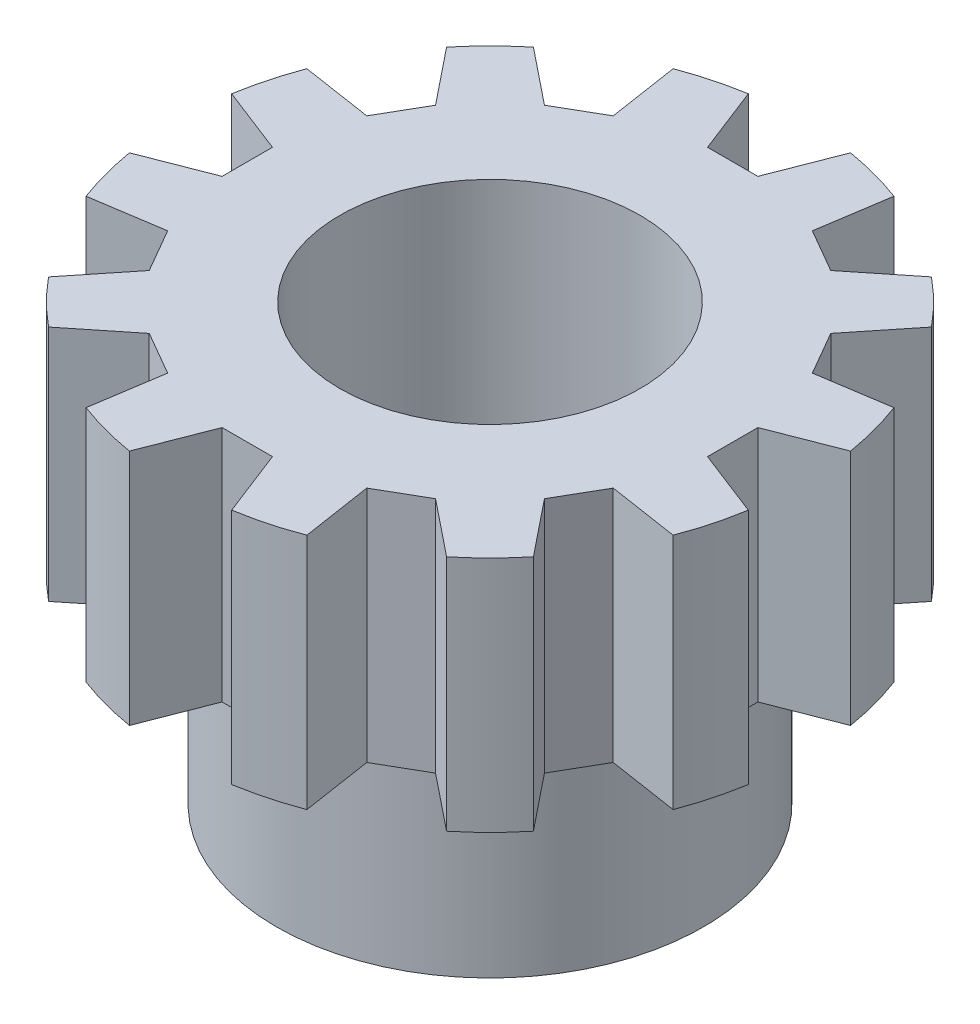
ISO-10303-21;
HEADER;
FILE_DESCRIPTION(('STEP AP214'),'2;1');
FILE_NAME('part.step','',(''),(''),'','','');
FILE_SCHEMA(('AUTOMOTIVE_DESIGN { 1 0 10303 214 1 1 1 1 }'));
ENDSEC;
DATA;
#1=APPLICATION_CONTEXT('core data for automotive mechanical design processes');
#2=APPLICATION_PROTOCOL_DEFINITION('international standard','automotive_design',2000,#1);
#3=PRODUCT_CONTEXT('',#1,'mechanical');
#4=PRODUCT('Part','Part','',(#3));
#5=PRODUCT_RELATED_PRODUCT_CATEGORY('part','',(#4));
#6=PRODUCT_DEFINITION_FORMATION('','',#4);
#7=PRODUCT_DEFINITION_CONTEXT('part definition',#1,'design');
#8=PRODUCT_DEFINITION('design','',#6,#7);
#9=PRODUCT_DEFINITION_SHAPE('','',#8);
#10=(LENGTH_UNIT() NAMED_UNIT(*) SI_UNIT(.MILLI.,.METRE.));
#11=(NAMED_UNIT(*) PLANE_ANGLE_UNIT() SI_UNIT($,.RADIAN.));
#12=(NAMED_UNIT(*) SI_UNIT($,.STERADIAN.) SOLID_ANGLE_UNIT());
#13=UNCERTAINTY_MEASURE_WITH_UNIT(LENGTH_MEASURE(1.E-05),#10,'distance_accuracy_value','');
#14=(GEOMETRIC_REPRESENTATION_CONTEXT(3) GLOBAL_UNCERTAINTY_ASSIGNED_CONTEXT((#13)) GLOBAL_UNIT_ASSIGNED_CONTEXT((#10,
#11,#12)) REPRESENTATION_CONTEXT('',''));
#15=CARTESIAN_POINT('',(0.,0.,0.));
#16=DIRECTION('',(0.,0.,1.));
#17=DIRECTION('',(1.,0.,0.));
#18=AXIS2_PLACEMENT_3D('',#15,#16,#17);
#19=CARTESIAN_POINT('',(6.7945,45.4025,0.));
#20=DIRECTION('',(0.,-1.,0.));
#21=DIRECTION('',(0.,0.,-1.));
#22=AXIS2_PLACEMENT_3D('',#19,#20,#21);
#23=CYLINDRICAL_SURFACE('',#22,5.96900000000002);
#24=CARTESIAN_POINT('',(6.7945,51.3714852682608,0.));
#25=DIRECTION('',(0.,-1.,0.));
#26=DIRECTION('',(0.,0.,-1.));
#27=AXIS2_PLACEMENT_3D('',#24,#25,#26);
#28=CIRCLE('',#27,5.96900000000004);
#29=CARTESIAN_POINT('',(2.18094974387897,51.3714852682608,-3.78736254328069));
#30=VERTEX_POINT('',#29);
#31=CARTESIAN_POINT('',(3.00713745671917,51.3714852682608,-4.61355025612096));
#32=VERTEX_POINT('',#31);
#33=EDGE_CURVE('E362',#30,#32,#28,.T.);
#34=ORIENTED_EDGE('',*,*,#33,.F.);
#35=DIRECTION('',(0.,1.,0.));
#36=VECTOR('',#35,1.);
#37=CARTESIAN_POINT('',(2.18094974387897,47.624,-3.78736254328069));
#38=LINE('',#37,#36);
#39=CARTESIAN_POINT('',(2.18094974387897,55.8940792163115,-3.78736254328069));
#40=VERTEX_POINT('',#39);
#41=EDGE_CURVE('E345',#30,#40,#38,.T.);
#42=ORIENTED_EDGE('',*,*,#41,.T.);
#43=CARTESIAN_POINT('',(6.7945,55.8940792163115,0.));
#44=DIRECTION('',(0.,-1.,0.));
#45=DIRECTION('',(0.,0.,-1.));
#46=AXIS2_PLACEMENT_3D('',#43,#44,#45);
#47=CIRCLE('',#46,5.969);
#48=CARTESIAN_POINT('',(3.0071374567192,55.8940792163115,-4.61355025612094));
#49=VERTEX_POINT('',#48);
#50=EDGE_CURVE('E54',#40,#49,#47,.T.);
#51=ORIENTED_EDGE('',*,*,#50,.T.);
#52=DIRECTION('',(0.,1.,0.));
#53=VECTOR('',#52,1.);
#54=CARTESIAN_POINT('',(3.0071374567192,47.624,-4.61355025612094));
#55=LINE('',#54,#53);
#56=EDGE_CURVE('E660',#32,#49,#55,.T.);
#57=ORIENTED_EDGE('',*,*,#56,.F.);
#58=EDGE_LOOP('',(#34,#42,#51,#57));
#59=FACE_BOUND('',#58,.T.);
#60=ADVANCED_FACE('F31',(#59),#23,.T.);
#61=CARTESIAN_POINT('',(4.69272954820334,51.3714852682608,-5.58672730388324));
#62=VERTEX_POINT('',#61);
#63=CARTESIAN_POINT('',(5.82132295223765,51.3714852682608,-5.88913299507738));
#64=VERTEX_POINT('',#63);
#65=EDGE_CURVE('E366',#62,#64,#28,.T.);
#66=ORIENTED_EDGE('',*,*,#65,.F.);
#67=DIRECTION('',(0.,1.,0.));
#68=VECTOR('',#67,1.);
#69=CARTESIAN_POINT('',(4.69272954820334,47.624,-5.58672730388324));
#70=LINE('',#69,#68);
#71=CARTESIAN_POINT('',(4.69272954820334,55.8940792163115,-5.58672730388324));
#72=VERTEX_POINT('',#71);
#73=EDGE_CURVE('E659',#62,#72,#70,.T.);
#74=ORIENTED_EDGE('',*,*,#73,.T.);
#75=CARTESIAN_POINT('',(5.82132295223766,55.8940792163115,-5.88913299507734));
#76=VERTEX_POINT('',#75);
#77=EDGE_CURVE('E375',#72,#76,#47,.T.);
#78=ORIENTED_EDGE('',*,*,#77,.T.);
#79=DIRECTION('',(0.,1.,0.));
#80=VECTOR('',#79,1.);
#81=CARTESIAN_POINT('',(5.82132295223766,47.624,-5.88913299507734));
#82=LINE('',#81,#80);
#83=EDGE_CURVE('E633',#64,#76,#82,.T.);
#84=ORIENTED_EDGE('',*,*,#83,.F.);
#85=EDGE_LOOP('',(#66,#74,#78,#84));
#86=FACE_BOUND('',#85,.T.);
#87=ADVANCED_FACE('F719',(#86),#23,.T.);
#88=CARTESIAN_POINT('',(7.76767704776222,51.3714852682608,-5.88913299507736));
#89=VERTEX_POINT('',#88);
#90=CARTESIAN_POINT('',(8.89627045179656,51.3714852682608,-5.58672730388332));
#91=VERTEX_POINT('',#90);
#92=EDGE_CURVE('E720',#89,#91,#28,.T.);
#93=ORIENTED_EDGE('',*,*,#92,.F.);
#94=DIRECTION('',(0.,1.,0.));
#95=VECTOR('',#94,1.);
#96=CARTESIAN_POINT('',(7.76767704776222,47.624,-5.88913299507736));
#97=LINE('',#96,#95);
#98=CARTESIAN_POINT('',(7.76767704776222,55.8940792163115,-5.88913299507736));
#99=VERTEX_POINT('',#98);
#100=EDGE_CURVE('E632',#89,#99,#97,.T.);
#101=ORIENTED_EDGE('',*,*,#100,.T.);
#102=CARTESIAN_POINT('',(8.89627045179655,55.8940792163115,-5.58672730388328));
#103=VERTEX_POINT('',#102);
#104=EDGE_CURVE('E774',#99,#103,#47,.T.);
#105=ORIENTED_EDGE('',*,*,#104,.T.);
#106=DIRECTION('',(0.,1.,0.));
#107=VECTOR('',#106,1.);
#108=CARTESIAN_POINT('',(8.89627045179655,47.624,-5.58672730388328));
#109=LINE('',#108,#107);
#110=EDGE_CURVE('E606',#91,#103,#109,.T.);
#111=ORIENTED_EDGE('',*,*,#110,.F.);
#112=EDGE_LOOP('',(#93,#101,#105,#111));
#113=FACE_BOUND('',#112,.T.);
#114=ADVANCED_FACE('F790',(#113),#23,.T.);
#115=CARTESIAN_POINT('',(10.5818625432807,51.3714852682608,-4.61355025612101));
#116=VERTEX_POINT('',#115);
#117=CARTESIAN_POINT('',(11.408050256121,51.3714852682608,-3.78736254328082));
#118=VERTEX_POINT('',#117);
#119=EDGE_CURVE('E721',#116,#118,#28,.T.);
#120=ORIENTED_EDGE('',*,*,#119,.F.);
#121=DIRECTION('',(0.,1.,0.));
#122=VECTOR('',#121,1.);
#123=CARTESIAN_POINT('',(10.5818625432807,47.624,-4.61355025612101));
#124=LINE('',#123,#122);
#125=CARTESIAN_POINT('',(10.5818625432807,55.8940792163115,-4.61355025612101));
#126=VERTEX_POINT('',#125);
#127=EDGE_CURVE('E605',#116,#126,#124,.T.);
#128=ORIENTED_EDGE('',*,*,#127,.T.);
#129=CARTESIAN_POINT('',(11.4080502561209,55.8940792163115,-3.78736254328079));
#130=VERTEX_POINT('',#129);
#131=EDGE_CURVE('E770',#126,#130,#47,.T.);
#132=ORIENTED_EDGE('',*,*,#131,.T.);
#133=DIRECTION('',(0.,1.,0.));
#134=VECTOR('',#133,1.);
#135=CARTESIAN_POINT('',(11.4080502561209,47.624,-3.78736254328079));
#136=LINE('',#135,#134);
#137=EDGE_CURVE('E579',#118,#130,#136,.T.);
#138=ORIENTED_EDGE('',*,*,#137,.F.);
#139=EDGE_LOOP('',(#120,#128,#132,#138));
#140=FACE_BOUND('',#139,.T.);
#141=ADVANCED_FACE('F800',(#140),#23,.T.);
#142=CARTESIAN_POINT('',(12.3812273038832,51.3714852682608,-2.10177045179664));
#143=VERTEX_POINT('',#142);
#144=CARTESIAN_POINT('',(12.6836329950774,51.3714852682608,-0.973177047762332));
#145=VERTEX_POINT('',#144);
#146=EDGE_CURVE('E725',#143,#145,#28,.T.);
#147=ORIENTED_EDGE('',*,*,#146,.F.);
#148=DIRECTION('',(0.,1.,0.));
#149=VECTOR('',#148,1.);
#150=CARTESIAN_POINT('',(12.3812273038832,47.624,-2.10177045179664));
#151=LINE('',#150,#149);
#152=CARTESIAN_POINT('',(12.3812273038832,55.8940792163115,-2.10177045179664));
#153=VERTEX_POINT('',#152);
#154=EDGE_CURVE('E578',#143,#153,#151,.T.);
#155=ORIENTED_EDGE('',*,*,#154,.T.);
#156=CARTESIAN_POINT('',(12.6836329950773,55.8940792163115,-0.973177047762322));
#157=VERTEX_POINT('',#156);
#158=EDGE_CURVE('E766',#153,#157,#47,.T.);
#159=ORIENTED_EDGE('',*,*,#158,.T.);
#160=DIRECTION('',(0.,1.,0.));
#161=VECTOR('',#160,1.);
#162=CARTESIAN_POINT('',(12.6836329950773,47.624,-0.973177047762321));
#163=LINE('',#162,#161);
#164=EDGE_CURVE('E552',#145,#157,#163,.T.);
#165=ORIENTED_EDGE('',*,*,#164,.F.);
#166=EDGE_LOOP('',(#147,#155,#159,#165));
#167=FACE_BOUND('',#166,.T.);
#168=ADVANCED_FACE('F810',(#167),#23,.T.);
#169=CARTESIAN_POINT('',(12.6836329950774,51.3714852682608,0.973177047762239));
#170=VERTEX_POINT('',#169);
#171=CARTESIAN_POINT('',(12.3812273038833,51.3714852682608,2.10177045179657));
#172=VERTEX_POINT('',#171);
#173=EDGE_CURVE('E729',#170,#172,#28,.T.);
#174=ORIENTED_EDGE('',*,*,#173,.F.);
#175=DIRECTION('',(0.,1.,0.));
#176=VECTOR('',#175,1.);
#177=CARTESIAN_POINT('',(12.6836329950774,47.624,0.973177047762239));
#178=LINE('',#177,#176);
#179=CARTESIAN_POINT('',(12.6836329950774,55.8940792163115,0.973177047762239));
#180=VERTEX_POINT('',#179);
#181=EDGE_CURVE('E551',#170,#180,#178,.T.);
#182=ORIENTED_EDGE('',*,*,#181,.T.);
#183=CARTESIAN_POINT('',(12.3812273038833,55.8940792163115,2.10177045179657));
#184=VERTEX_POINT('',#183);
#185=EDGE_CURVE('E762',#180,#184,#47,.T.);
#186=ORIENTED_EDGE('',*,*,#185,.T.);
#187=DIRECTION('',(0.,1.,0.));
#188=VECTOR('',#187,1.);
#189=CARTESIAN_POINT('',(12.3812273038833,47.624,2.10177045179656));
#190=LINE('',#189,#188);
#191=EDGE_CURVE('E525',#172,#184,#190,.T.);
#192=ORIENTED_EDGE('',*,*,#191,.F.);
#193=EDGE_LOOP('',(#174,#182,#186,#192));
#194=FACE_BOUND('',#193,.T.);
#195=ADVANCED_FACE('F820',(#194),#23,.T.);
#196=CARTESIAN_POINT('',(11.408050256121,51.3714852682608,3.78736254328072));
#197=VERTEX_POINT('',#196);
#198=CARTESIAN_POINT('',(10.5818625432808,51.3714852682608,4.61355025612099));
#199=VERTEX_POINT('',#198);
#200=EDGE_CURVE('E733',#197,#199,#28,.T.);
#201=ORIENTED_EDGE('',*,*,#200,.F.);
#202=DIRECTION('',(0.,1.,0.));
#203=VECTOR('',#202,1.);
#204=CARTESIAN_POINT('',(11.408050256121,47.624,3.78736254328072));
#205=LINE('',#204,#203);
#206=CARTESIAN_POINT('',(11.408050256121,55.8940792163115,3.78736254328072));
#207=VERTEX_POINT('',#206);
#208=EDGE_CURVE('E524',#197,#207,#205,.T.);
#209=ORIENTED_EDGE('',*,*,#208,.T.);
#210=CARTESIAN_POINT('',(10.5818625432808,55.8940792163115,4.61355025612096));
#211=VERTEX_POINT('',#210);
#212=EDGE_CURVE('E758',#207,#211,#47,.T.);
#213=ORIENTED_EDGE('',*,*,#212,.T.);
#214=DIRECTION('',(0.,1.,0.));
#215=VECTOR('',#214,1.);
#216=CARTESIAN_POINT('',(10.5818625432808,47.624,4.61355025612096));
#217=LINE('',#216,#215);
#218=EDGE_CURVE('E498',#199,#211,#217,.T.);
#219=ORIENTED_EDGE('',*,*,#218,.F.);
#220=EDGE_LOOP('',(#201,#209,#213,#219));
#221=FACE_BOUND('',#220,.T.);
#222=ADVANCED_FACE('F830',(#221),#23,.T.);
#223=CARTESIAN_POINT('',(8.89627045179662,51.3714852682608,5.58672730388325));
#224=VERTEX_POINT('',#223);
#225=CARTESIAN_POINT('',(7.76767704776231,51.3714852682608,5.88913299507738));
#226=VERTEX_POINT('',#225);
#227=EDGE_CURVE('E737',#224,#226,#28,.T.);
#228=ORIENTED_EDGE('',*,*,#227,.F.);
#229=DIRECTION('',(0.,1.,0.));
#230=VECTOR('',#229,1.);
#231=CARTESIAN_POINT('',(8.89627045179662,47.624,5.58672730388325));
#232=LINE('',#231,#230);
#233=CARTESIAN_POINT('',(8.89627045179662,55.8940792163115,5.58672730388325));
#234=VERTEX_POINT('',#233);
#235=EDGE_CURVE('E497',#224,#234,#232,.T.);
#236=ORIENTED_EDGE('',*,*,#235,.T.);
#237=CARTESIAN_POINT('',(7.7676770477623,55.8940792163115,5.88913299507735));
#238=VERTEX_POINT('',#237);
#239=EDGE_CURVE('E757',#234,#238,#47,.T.);
#240=ORIENTED_EDGE('',*,*,#239,.T.);
#241=DIRECTION('',(0.,1.,0.));
#242=VECTOR('',#241,1.);
#243=CARTESIAN_POINT('',(7.7676770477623,47.624,5.88913299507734));
#244=LINE('',#243,#242);
#245=EDGE_CURVE('E471',#226,#238,#244,.T.);
#246=ORIENTED_EDGE('',*,*,#245,.F.);
#247=EDGE_LOOP('',(#228,#236,#240,#246));
#248=FACE_BOUND('',#247,.T.);
#249=ADVANCED_FACE('F840',(#248),#23,.T.);
#250=CARTESIAN_POINT('',(5.82132295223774,51.3714852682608,5.88913299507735));
#251=VERTEX_POINT('',#250);
#252=CARTESIAN_POINT('',(4.69272954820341,51.3714852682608,5.5867273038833));
#253=VERTEX_POINT('',#252);
#254=EDGE_CURVE('E373',#251,#253,#28,.T.);
#255=ORIENTED_EDGE('',*,*,#254,.F.);
#256=DIRECTION('',(0.,1.,0.));
#257=VECTOR('',#256,1.);
#258=CARTESIAN_POINT('',(5.82132295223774,47.624,5.88913299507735));
#259=LINE('',#258,#257);
#260=CARTESIAN_POINT('',(5.82132295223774,55.8940792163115,5.88913299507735));
#261=VERTEX_POINT('',#260);
#262=EDGE_CURVE('E470',#251,#261,#259,.T.);
#263=ORIENTED_EDGE('',*,*,#262,.T.);
#264=CARTESIAN_POINT('',(4.69272954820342,55.8940792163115,5.58672730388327));
#265=VERTEX_POINT('',#264);
#266=EDGE_CURVE('E384',#261,#265,#47,.T.);
#267=ORIENTED_EDGE('',*,*,#266,.T.);
#268=DIRECTION('',(0.,1.,0.));
#269=VECTOR('',#268,1.);
#270=CARTESIAN_POINT('',(4.69272954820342,47.624,5.58672730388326));
#271=LINE('',#270,#269);
#272=EDGE_CURVE('E444',#253,#265,#271,.T.);
#273=ORIENTED_EDGE('',*,*,#272,.F.);
#274=EDGE_LOOP('',(#255,#263,#267,#273));
#275=FACE_BOUND('',#274,.T.);
#276=ADVANCED_FACE('F754',(#275),#23,.T.);
#277=CARTESIAN_POINT('',(3.00713745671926,51.3714852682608,4.61355025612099));
#278=VERTEX_POINT('',#277);
#279=CARTESIAN_POINT('',(2.180949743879,51.3714852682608,3.78736254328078));
#280=VERTEX_POINT('',#279);
#281=EDGE_CURVE('E368',#278,#280,#28,.T.);
#282=ORIENTED_EDGE('',*,*,#281,.F.);
#283=DIRECTION('',(0.,1.,0.));
#284=VECTOR('',#283,1.);
#285=CARTESIAN_POINT('',(3.00713745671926,47.624,4.61355025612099));
#286=LINE('',#285,#284);
#287=CARTESIAN_POINT('',(3.00713745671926,55.8940792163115,4.61355025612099));
#288=VERTEX_POINT('',#287);
#289=EDGE_CURVE('E443',#278,#288,#286,.T.);
#290=ORIENTED_EDGE('',*,*,#289,.T.);
#291=CARTESIAN_POINT('',(2.18094974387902,55.8940792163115,3.78736254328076));
#292=VERTEX_POINT('',#291);
#293=EDGE_CURVE('E377',#288,#292,#47,.T.);
#294=ORIENTED_EDGE('',*,*,#293,.T.);
#295=DIRECTION('',(0.,1.,0.));
#296=VECTOR('',#295,1.);
#297=CARTESIAN_POINT('',(2.18094974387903,47.624,3.78736254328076));
#298=LINE('',#297,#296);
#299=EDGE_CURVE('E418',#280,#292,#298,.T.);
#300=ORIENTED_EDGE('',*,*,#299,.F.);
#301=EDGE_LOOP('',(#282,#290,#294,#300));
#302=FACE_BOUND('',#301,.T.);
#303=ADVANCED_FACE('F876',(#302),#23,.T.);
#304=CARTESIAN_POINT('',(1.20777269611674,51.3714852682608,2.1017704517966));
#305=VERTEX_POINT('',#304);
#306=CARTESIAN_POINT('',(0.905367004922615,51.3714852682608,0.973177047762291));
#307=VERTEX_POINT('',#306);
#308=EDGE_CURVE('E364',#305,#307,#28,.T.);
#309=ORIENTED_EDGE('',*,*,#308,.F.);
#310=DIRECTION('',(0.,1.,0.));
#311=VECTOR('',#310,1.);
#312=CARTESIAN_POINT('',(1.20777269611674,47.624,2.1017704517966));
#313=LINE('',#312,#311);
#314=CARTESIAN_POINT('',(1.20777269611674,55.8940792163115,2.1017704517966));
#315=VERTEX_POINT('',#314);
#316=EDGE_CURVE('E417',#305,#315,#313,.T.);
#317=ORIENTED_EDGE('',*,*,#316,.T.);
#318=CARTESIAN_POINT('',(0.905367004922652,55.8940792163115,0.973177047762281));
#319=VERTEX_POINT('',#318);
#320=EDGE_CURVE('E374',#315,#319,#47,.T.);
#321=ORIENTED_EDGE('',*,*,#320,.T.);
#322=DIRECTION('',(0.,1.,0.));
#323=VECTOR('',#322,1.);
#324=CARTESIAN_POINT('',(0.905367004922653,47.624,0.97317704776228));
#325=LINE('',#324,#323);
#326=EDGE_CURVE('E395',#307,#319,#325,.T.);
#327=ORIENTED_EDGE('',*,*,#326,.F.);
#328=EDGE_LOOP('',(#309,#317,#321,#327));
#329=FACE_BOUND('',#328,.T.);
#330=ADVANCED_FACE('F867',(#329),#23,.T.);
#331=CARTESIAN_POINT('',(3.937,47.625,0.));
#332=DIRECTION('',(0.,1.,0.));
#333=DIRECTION('',(0.,0.,1.));
#334=AXIS2_PLACEMENT_3D('',#331,#332,#333);
#335=PLANE('',#334);
#336=CARTESIAN_POINT('',(6.7945,47.625,0.));
#337=DIRECTION('',(0.,-1.,0.));
#338=DIRECTION('',(0.,0.,-1.));
#339=AXIS2_PLACEMENT_3D('',#336,#337,#338);
#340=CIRCLE('',#339,2.8575);
#341=CARTESIAN_POINT('',(6.7945,47.625,-2.8575));
#342=VERTEX_POINT('',#341);
#343=EDGE_CURVE('E386',#342,#342,#340,.T.);
#344=ORIENTED_EDGE('',*,*,#343,.F.);
#345=EDGE_LOOP('',(#344));
#346=FACE_BOUND('',#345,.T.);
#347=CARTESIAN_POINT('',(6.7945,47.625,0.));
#348=DIRECTION('',(0.,-1.,0.));
#349=DIRECTION('',(0.,0.,-1.));
#350=AXIS2_PLACEMENT_3D('',#347,#348,#349);
#351=CIRCLE('',#350,4.064);
#352=CARTESIAN_POINT('',(6.7945,47.625,-4.064));
#353=VERTEX_POINT('',#352);
#354=EDGE_CURVE('E11',#353,#353,#351,.T.);
#355=ORIENTED_EDGE('',*,*,#354,.T.);
#356=EDGE_LOOP('',(#355));
#357=FACE_BOUND('',#356,.T.);
#358=ADVANCED_FACE('F33',(#346,#357),#335,.F.);
#359=CARTESIAN_POINT('',(6.7945,45.4025,0.));
#360=DIRECTION('',(0.,-1.,0.));
#361=DIRECTION('',(0.,0.,-1.));
#362=AXIS2_PLACEMENT_3D('',#359,#360,#361);
#363=CYLINDRICAL_SURFACE('',#362,4.064);
#364=ORIENTED_EDGE('',*,*,#354,.F.);
#365=EDGE_LOOP('',(#364));
#366=FACE_BOUND('',#365,.T.);
#367=CARTESIAN_POINT('',(6.7945,51.3714852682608,0.));
#368=DIRECTION('',(0.,-1.,0.));
#369=DIRECTION('',(0.,0.,-1.));
#370=AXIS2_PLACEMENT_3D('',#367,#368,#369);
#371=CIRCLE('',#370,4.064);
#372=CARTESIAN_POINT('',(6.7945,51.3714852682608,-4.064));
#373=VERTEX_POINT('',#372);
#374=EDGE_CURVE('E39',#373,#373,#371,.T.);
#375=ORIENTED_EDGE('',*,*,#374,.T.);
#376=EDGE_LOOP('',(#375));
#377=FACE_BOUND('',#376,.T.);
#378=ADVANCED_FACE('F873',(#366,#377),#363,.T.);
#379=CARTESIAN_POINT('',(2.7305,51.3714852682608,0.));
#380=DIRECTION('',(0.,1.,0.));
#381=DIRECTION('',(0.,0.,1.));
#382=AXIS2_PLACEMENT_3D('',#379,#380,#381);
#383=PLANE('',#382);
#384=ORIENTED_EDGE('',*,*,#374,.F.);
#385=EDGE_LOOP('',(#384));
#386=FACE_BOUND('',#385,.T.);
#387=DIRECTION('',(-0.499999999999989,0.,0.866025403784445));
#388=VECTOR('',#387,1.);
#389=CARTESIAN_POINT('',(2.5546674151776,51.3714852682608,-1.89466053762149));
#390=LINE('',#389,#388);
#391=CARTESIAN_POINT('',(3.03375955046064,51.3714852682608,-2.7244724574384));
#392=VERTEX_POINT('',#391);
#393=CARTESIAN_POINT('',(2.5546674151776,51.3714852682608,-1.89466053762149));
#394=VERTEX_POINT('',#393);
#395=EDGE_CURVE('E694',#392,#394,#390,.T.);
#396=ORIENTED_EDGE('',*,*,#395,.F.);
#397=DIRECTION('',(0.625812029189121,0.,0.779973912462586));
#398=VECTOR('',#397,1.);
#399=CARTESIAN_POINT('',(3.03375955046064,51.3714852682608,-2.7244724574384));
#400=LINE('',#399,#398);
#401=EDGE_CURVE('E691',#30,#392,#400,.T.);
#402=ORIENTED_EDGE('',*,*,#401,.F.);
#403=ORIENTED_EDGE('',*,*,#33,.T.);
#404=DIRECTION('',(-0.779973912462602,0.,-0.625812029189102));
#405=VECTOR('',#404,1.);
#406=CARTESIAN_POINT('',(4.07002754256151,51.3714852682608,-3.76074044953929));
#407=LINE('',#406,#405);
#408=CARTESIAN_POINT('',(4.07002754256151,51.3714852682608,-3.76074044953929));
#409=VERTEX_POINT('',#408);
#410=EDGE_CURVE('E656',#409,#32,#407,.T.);
#411=ORIENTED_EDGE('',*,*,#410,.F.);
#412=DIRECTION('',(-0.866025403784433,0.,0.50000000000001));
#413=VECTOR('',#412,1.);
#414=CARTESIAN_POINT('',(4.07002754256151,51.3714852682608,-3.76074044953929));
#415=LINE('',#414,#413);
#416=CARTESIAN_POINT('',(4.89983946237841,51.3714852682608,-4.23983258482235));
#417=VERTEX_POINT('',#416);
#418=EDGE_CURVE('E344',#417,#409,#415,.T.);
#419=ORIENTED_EDGE('',*,*,#418,.F.);
#420=DIRECTION('',(0.151982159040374,0.,0.988383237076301));
#421=VECTOR('',#420,1.);
#422=CARTESIAN_POINT('',(4.89983946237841,51.3714852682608,-4.23983258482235));
#423=LINE('',#422,#421);
#424=EDGE_CURVE('E676',#62,#417,#423,.T.);
#425=ORIENTED_EDGE('',*,*,#424,.F.);
#426=ORIENTED_EDGE('',*,*,#65,.T.);
#427=DIRECTION('',(-0.362571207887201,0.,-0.931956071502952));
#428=VECTOR('',#427,1.);
#429=CARTESIAN_POINT('',(6.3154078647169,51.3714852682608,-4.61913299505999));
#430=LINE('',#429,#428);
#431=CARTESIAN_POINT('',(6.3154078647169,51.3714852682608,-4.61913299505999));
#432=VERTEX_POINT('',#431);
#433=EDGE_CURVE('E629',#432,#64,#430,.T.);
#434=ORIENTED_EDGE('',*,*,#433,.F.);
#435=DIRECTION('',(-1.,0.,0.));
#436=VECTOR('',#435,1.);
#437=CARTESIAN_POINT('',(6.3154078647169,51.3714852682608,-4.61913299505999));
#438=LINE('',#437,#436);
#439=CARTESIAN_POINT('',(7.273592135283,51.3714852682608,-4.61913299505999));
#440=VERTEX_POINT('',#439);
#441=EDGE_CURVE('E653',#440,#432,#438,.T.);
#442=ORIENTED_EDGE('',*,*,#441,.F.);
#443=DIRECTION('',(-0.362571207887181,0.,0.93195607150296));
#444=VECTOR('',#443,1.);
#445=CARTESIAN_POINT('',(7.273592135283,51.3714852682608,-4.61913299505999));
#446=LINE('',#445,#444);
#447=EDGE_CURVE('E650',#89,#440,#446,.T.);
#448=ORIENTED_EDGE('',*,*,#447,.F.);
#449=ORIENTED_EDGE('',*,*,#92,.T.);
#450=DIRECTION('',(0.151982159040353,0.,-0.988383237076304));
#451=VECTOR('',#450,1.);
#452=CARTESIAN_POINT('',(8.6891605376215,51.3714852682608,-4.23983258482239));
#453=LINE('',#452,#451);
#454=CARTESIAN_POINT('',(8.6891605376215,51.3714852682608,-4.23983258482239));
#455=VERTEX_POINT('',#454);
#456=EDGE_CURVE('E602',#455,#91,#453,.T.);
#457=ORIENTED_EDGE('',*,*,#456,.F.);
#458=DIRECTION('',(-0.866025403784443,0.,-0.499999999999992));
#459=VECTOR('',#458,1.);
#460=CARTESIAN_POINT('',(8.6891605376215,51.3714852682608,-4.23983258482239));
#461=LINE('',#460,#459);
#462=CARTESIAN_POINT('',(9.51897245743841,51.3714852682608,-3.76074044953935));
#463=VERTEX_POINT('',#462);
#464=EDGE_CURVE('E626',#463,#455,#461,.T.);
#465=ORIENTED_EDGE('',*,*,#464,.F.);
#466=DIRECTION('',(-0.779973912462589,0.,0.625812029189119));
#467=VECTOR('',#466,1.);
#468=CARTESIAN_POINT('',(9.51897245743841,51.3714852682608,-3.76074044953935));
#469=LINE('',#468,#467);
#470=EDGE_CURVE('E623',#116,#463,#469,.T.);
#471=ORIENTED_EDGE('',*,*,#470,.F.);
#472=ORIENTED_EDGE('',*,*,#119,.T.);
#473=DIRECTION('',(0.625812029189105,0.,-0.7799739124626));
#474=VECTOR('',#473,1.);
#475=CARTESIAN_POINT('',(10.5552404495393,51.3714852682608,-2.72447245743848));
#476=LINE('',#475,#474);
#477=CARTESIAN_POINT('',(10.5552404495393,51.3714852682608,-2.72447245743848));
#478=VERTEX_POINT('',#477);
#479=EDGE_CURVE('E575',#478,#118,#476,.T.);
#480=ORIENTED_EDGE('',*,*,#479,.F.);
#481=DIRECTION('',(-0.500000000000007,0.,-0.866025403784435));
#482=VECTOR('',#481,1.);
#483=CARTESIAN_POINT('',(10.5552404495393,51.3714852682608,-2.72447245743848));
#484=LINE('',#483,#482);
#485=CARTESIAN_POINT('',(11.0343325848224,51.3714852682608,-1.89466053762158));
#486=VERTEX_POINT('',#485);
#487=EDGE_CURVE('E599',#486,#478,#484,.T.);
#488=ORIENTED_EDGE('',*,*,#487,.F.);
#489=DIRECTION('',(-0.988383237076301,0.,0.15198215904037));
#490=VECTOR('',#489,1.);
#491=CARTESIAN_POINT('',(11.0343325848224,51.3714852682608,-1.89466053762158));
#492=LINE('',#491,#490);
#493=EDGE_CURVE('E596',#143,#486,#492,.T.);
#494=ORIENTED_EDGE('',*,*,#493,.F.);
#495=ORIENTED_EDGE('',*,*,#146,.T.);
#496=DIRECTION('',(0.931956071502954,0.,-0.362571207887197));
#497=VECTOR('',#496,1.);
#498=CARTESIAN_POINT('',(11.41363299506,51.3714852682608,-0.479092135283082));
#499=LINE('',#498,#497);
#500=CARTESIAN_POINT('',(11.41363299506,51.3714852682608,-0.479092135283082));
#501=VERTEX_POINT('',#500);
#502=EDGE_CURVE('E548',#501,#145,#499,.T.);
#503=ORIENTED_EDGE('',*,*,#502,.F.);
#504=DIRECTION('',(0.,0.,-1.));
#505=VECTOR('',#504,1.);
#506=CARTESIAN_POINT('',(11.41363299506,51.3714852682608,-0.479092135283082));
#507=LINE('',#506,#505);
#508=CARTESIAN_POINT('',(11.41363299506,51.3714852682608,0.479092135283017));
#509=VERTEX_POINT('',#508);
#510=EDGE_CURVE('E572',#509,#501,#507,.T.);
#511=ORIENTED_EDGE('',*,*,#510,.F.);
#512=DIRECTION('',(-0.931956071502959,0.,-0.362571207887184));
#513=VECTOR('',#512,1.);
#514=CARTESIAN_POINT('',(11.41363299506,51.3714852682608,0.479092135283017));
#515=LINE('',#514,#513);
#516=EDGE_CURVE('E569',#170,#509,#515,.T.);
#517=ORIENTED_EDGE('',*,*,#516,.F.);
#518=ORIENTED_EDGE('',*,*,#173,.T.);
#519=DIRECTION('',(0.988383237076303,0.,0.151982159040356));
#520=VECTOR('',#519,1.);
#521=CARTESIAN_POINT('',(11.0343325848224,51.3714852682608,1.89466053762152));
#522=LINE('',#521,#520);
#523=CARTESIAN_POINT('',(11.0343325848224,51.3714852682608,1.89466053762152));
#524=VERTEX_POINT('',#523);
#525=EDGE_CURVE('E521',#524,#172,#522,.T.);
#526=ORIENTED_EDGE('',*,*,#525,.F.);
#527=DIRECTION('',(0.499999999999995,0.,-0.866025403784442));
#528=VECTOR('',#527,1.);
#529=CARTESIAN_POINT('',(11.0343325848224,51.3714852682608,1.89466053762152));
#530=LINE('',#529,#528);
#531=CARTESIAN_POINT('',(10.5552404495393,51.3714852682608,2.72447245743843));
#532=VERTEX_POINT('',#531);
#533=EDGE_CURVE('E545',#532,#524,#530,.T.);
#534=ORIENTED_EDGE('',*,*,#533,.F.);
#535=DIRECTION('',(-0.625812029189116,0.,-0.779973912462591));
#536=VECTOR('',#535,1.);
#537=CARTESIAN_POINT('',(10.5552404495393,51.3714852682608,2.72447245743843));
#538=LINE('',#537,#536);
#539=EDGE_CURVE('E542',#197,#532,#538,.T.);
#540=ORIENTED_EDGE('',*,*,#539,.F.);
#541=ORIENTED_EDGE('',*,*,#200,.T.);
#542=DIRECTION('',(0.779973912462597,0.,0.625812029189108));
#543=VECTOR('',#542,1.);
#544=CARTESIAN_POINT('',(9.51897245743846,51.3714852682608,3.76074044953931));
#545=LINE('',#544,#543);
#546=CARTESIAN_POINT('',(9.51897245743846,51.3714852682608,3.76074044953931));
#547=VERTEX_POINT('',#546);
#548=EDGE_CURVE('E494',#547,#199,#545,.T.);
#549=ORIENTED_EDGE('',*,*,#548,.F.);
#550=DIRECTION('',(0.866025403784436,0.,-0.500000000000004));
#551=VECTOR('',#550,1.);
#552=CARTESIAN_POINT('',(9.51897245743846,51.3714852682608,3.76074044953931));
#553=LINE('',#552,#551);
#554=CARTESIAN_POINT('',(8.68916053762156,51.3714852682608,4.23983258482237));
#555=VERTEX_POINT('',#554);
#556=EDGE_CURVE('E518',#555,#547,#553,.T.);
#557=ORIENTED_EDGE('',*,*,#556,.F.);
#558=DIRECTION('',(-0.151982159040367,0.,-0.988383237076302));
#559=VECTOR('',#558,1.);
#560=CARTESIAN_POINT('',(8.68916053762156,51.3714852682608,4.23983258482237));
#561=LINE('',#560,#559);
#562=EDGE_CURVE('E515',#224,#555,#561,.T.);
#563=ORIENTED_EDGE('',*,*,#562,.F.);
#564=ORIENTED_EDGE('',*,*,#227,.T.);
#565=DIRECTION('',(0.362571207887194,0.,0.931956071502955));
#566=VECTOR('',#565,1.);
#567=CARTESIAN_POINT('',(7.27359213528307,51.3714852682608,4.61913299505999));
#568=LINE('',#567,#566);
#569=CARTESIAN_POINT('',(7.27359213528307,51.3714852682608,4.61913299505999));
#570=VERTEX_POINT('',#569);
#571=EDGE_CURVE('E467',#570,#226,#568,.T.);
#572=ORIENTED_EDGE('',*,*,#571,.F.);
#573=DIRECTION('',(1.,0.,0.));
#574=VECTOR('',#573,1.);
#575=CARTESIAN_POINT('',(7.27359213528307,51.3714852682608,4.61913299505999));
#576=LINE('',#575,#574);
#577=CARTESIAN_POINT('',(6.31540786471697,51.3714852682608,4.61913299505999));
#578=VERTEX_POINT('',#577);
#579=EDGE_CURVE('E491',#578,#570,#576,.T.);
#580=ORIENTED_EDGE('',*,*,#579,.F.);
#581=DIRECTION('',(0.362571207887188,0.,-0.931956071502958));
#582=VECTOR('',#581,1.);
#583=CARTESIAN_POINT('',(6.31540786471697,51.3714852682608,4.61913299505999));
#584=LINE('',#583,#582);
#585=EDGE_CURVE('E488',#251,#578,#584,.T.);
#586=ORIENTED_EDGE('',*,*,#585,.F.);
#587=ORIENTED_EDGE('',*,*,#254,.T.);
#588=DIRECTION('',(-0.15198215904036,0.,0.988383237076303));
#589=VECTOR('',#588,1.);
#590=CARTESIAN_POINT('',(4.89983946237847,51.3714852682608,4.23983258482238));
#591=LINE('',#590,#589);
#592=CARTESIAN_POINT('',(4.89983946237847,51.3714852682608,4.23983258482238));
#593=VERTEX_POINT('',#592);
#594=EDGE_CURVE('E440',#593,#253,#591,.T.);
#595=ORIENTED_EDGE('',*,*,#594,.F.);
#596=DIRECTION('',(0.86602540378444,0.,0.499999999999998));
#597=VECTOR('',#596,1.);
#598=CARTESIAN_POINT('',(4.89983946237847,51.3714852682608,4.23983258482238));
#599=LINE('',#598,#597);
#600=CARTESIAN_POINT('',(4.07002754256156,51.3714852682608,3.76074044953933));
#601=VERTEX_POINT('',#600);
#602=EDGE_CURVE('E464',#601,#593,#599,.T.);
#603=ORIENTED_EDGE('',*,*,#602,.F.);
#604=DIRECTION('',(0.779973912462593,0.,-0.625812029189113));
#605=VECTOR('',#604,1.);
#606=CARTESIAN_POINT('',(4.07002754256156,51.3714852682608,3.76074044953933));
#607=LINE('',#606,#605);
#608=EDGE_CURVE('E461',#278,#601,#607,.T.);
#609=ORIENTED_EDGE('',*,*,#608,.F.);
#610=ORIENTED_EDGE('',*,*,#281,.T.);
#611=DIRECTION('',(-0.625812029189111,0.,0.779973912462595));
#612=VECTOR('',#611,1.);
#613=CARTESIAN_POINT('',(3.03375955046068,51.3714852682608,2.72447245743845));
#614=LINE('',#613,#612);
#615=CARTESIAN_POINT('',(3.03375955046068,51.3714852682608,2.72447245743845));
#616=VERTEX_POINT('',#615);
#617=EDGE_CURVE('E414',#616,#280,#614,.T.);
#618=ORIENTED_EDGE('',*,*,#617,.F.);
#619=DIRECTION('',(0.500000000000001,0.,0.866025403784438));
#620=VECTOR('',#619,1.);
#621=CARTESIAN_POINT('',(3.03375955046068,51.3714852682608,2.72447245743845));
#622=LINE('',#621,#620);
#623=CARTESIAN_POINT('',(2.55466741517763,51.3714852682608,1.89466053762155));
#624=VERTEX_POINT('',#623);
#625=EDGE_CURVE('E437',#624,#616,#622,.T.);
#626=ORIENTED_EDGE('',*,*,#625,.F.);
#627=DIRECTION('',(0.988383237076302,0.,-0.151982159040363));
#628=VECTOR('',#627,1.);
#629=CARTESIAN_POINT('',(2.55466741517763,51.3714852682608,1.89466053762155));
#630=LINE('',#629,#628);
#631=EDGE_CURVE('E434',#305,#624,#630,.T.);
#632=ORIENTED_EDGE('',*,*,#631,.F.);
#633=ORIENTED_EDGE('',*,*,#308,.T.);
#634=DIRECTION('',(-0.931956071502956,0.,0.362571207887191));
#635=VECTOR('',#634,1.);
#636=CARTESIAN_POINT('',(2.17536700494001,51.3714852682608,0.47909213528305));
#637=LINE('',#636,#635);
#638=CARTESIAN_POINT('',(2.17536700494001,51.3714852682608,0.47909213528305));
#639=VERTEX_POINT('',#638);
#640=EDGE_CURVE('E390',#639,#307,#637,.T.);
#641=ORIENTED_EDGE('',*,*,#640,.F.);
#642=DIRECTION('',(0.,0.,1.));
#643=VECTOR('',#642,1.);
#644=CARTESIAN_POINT('',(2.17536700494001,51.3714852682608,0.47909213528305));
#645=LINE('',#644,#643);
#646=CARTESIAN_POINT('',(2.17536700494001,51.3714852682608,-0.47909213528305));
#647=VERTEX_POINT('',#646);
#648=EDGE_CURVE('E411',#647,#639,#645,.T.);
#649=ORIENTED_EDGE('',*,*,#648,.F.);
#650=DIRECTION('',(0.931956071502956,0.,0.362571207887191));
#651=VECTOR('',#650,1.);
#652=CARTESIAN_POINT('',(2.17536700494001,51.3714852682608,-0.47909213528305));
#653=LINE('',#652,#651);
#654=CARTESIAN_POINT('',(0.905367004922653,51.3714852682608,-0.97317704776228));
#655=VERTEX_POINT('',#654);
#656=EDGE_CURVE('E361',#655,#647,#653,.T.);
#657=ORIENTED_EDGE('',*,*,#656,.F.);
#658=CARTESIAN_POINT('',(1.20777269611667,51.3714852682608,-2.10177045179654));
#659=VERTEX_POINT('',#658);
#660=EDGE_CURVE('E352',#655,#659,#28,.T.);
#661=ORIENTED_EDGE('',*,*,#660,.T.);
#662=DIRECTION('',(-0.988383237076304,0.,-0.151982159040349));
#663=VECTOR('',#662,1.);
#664=CARTESIAN_POINT('',(2.5546674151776,51.3714852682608,-1.89466053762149));
#665=LINE('',#664,#663);
#666=EDGE_CURVE('E337',#394,#659,#665,.T.);
#667=ORIENTED_EDGE('',*,*,#666,.F.);
#668=EDGE_LOOP('',(#396,#402,#403,#411,#419,#425,#426,#434,#442,#448,#449,#457,#465,#471,#472,
#480,#488,#494,#495,#503,#511,#517,#518,#526,#534,#540,#541,#549,#557,#563,#564,#572,#580,#586,
#587,#595,#603,#609,#610,#618,#626,#632,#633,#641,#649,#657,#661,#667));
#669=FACE_BOUND('',#668,.T.);
#670=ADVANCED_FACE('F358',(#386,#669),#383,.F.);
#671=CARTESIAN_POINT('',(0.905367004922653,55.8940792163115,-0.97317704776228));
#672=VERTEX_POINT('',#671);
#673=CARTESIAN_POINT('',(1.20777269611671,55.8940792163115,-2.10177045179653));
#674=VERTEX_POINT('',#673);
#675=EDGE_CURVE('E354',#672,#674,#47,.T.);
#676=ORIENTED_EDGE('',*,*,#675,.T.);
#677=DIRECTION('',(0.,1.,0.));
#678=VECTOR('',#677,1.);
#679=CARTESIAN_POINT('',(1.20777269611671,47.624,-2.10177045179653));
#680=LINE('',#679,#678);
#681=EDGE_CURVE('E46',#659,#674,#680,.T.);
#682=ORIENTED_EDGE('',*,*,#681,.F.);
#683=ORIENTED_EDGE('',*,*,#660,.F.);
#684=DIRECTION('',(0.,1.,0.));
#685=VECTOR('',#684,1.);
#686=CARTESIAN_POINT('',(0.905367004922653,47.624,-0.97317704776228));
#687=LINE('',#686,#685);
#688=EDGE_CURVE('E394',#655,#672,#687,.T.);
#689=ORIENTED_EDGE('',*,*,#688,.T.);
#690=EDGE_LOOP('',(#676,#682,#683,#689));
#691=FACE_BOUND('',#690,.T.);
#692=ADVANCED_FACE('F350',(#691),#23,.T.);
#693=CARTESIAN_POINT('',(0.8255,55.8940792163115,0.));
#694=DIRECTION('',(0.,-1.,0.));
#695=DIRECTION('',(0.,0.,-1.));
#696=AXIS2_PLACEMENT_3D('',#693,#694,#695);
#697=PLANE('',#696);
#698=ORIENTED_EDGE('',*,*,#50,.F.);
#699=DIRECTION('',(-0.625812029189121,0.,-0.779973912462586));
#700=VECTOR('',#699,1.);
#701=CARTESIAN_POINT('',(3.03375955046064,55.8940792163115,-2.7244724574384));
#702=LINE('',#701,#700);
#703=CARTESIAN_POINT('',(3.03375955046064,55.8940792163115,-2.7244724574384));
#704=VERTEX_POINT('',#703);
#705=EDGE_CURVE('E355',#704,#40,#702,.T.);
#706=ORIENTED_EDGE('',*,*,#705,.F.);
#707=DIRECTION('',(0.499999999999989,0.,-0.866025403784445));
#708=VECTOR('',#707,1.);
#709=CARTESIAN_POINT('',(2.5546674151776,55.8940792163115,-1.89466053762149));
#710=LINE('',#709,#708);
#711=CARTESIAN_POINT('',(2.5546674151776,55.8940792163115,-1.89466053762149));
#712=VERTEX_POINT('',#711);
#713=EDGE_CURVE('E686',#712,#704,#710,.T.);
#714=ORIENTED_EDGE('',*,*,#713,.F.);
#715=DIRECTION('',(0.988383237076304,0.,0.151982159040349));
#716=VECTOR('',#715,1.);
#717=CARTESIAN_POINT('',(2.5546674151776,55.8940792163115,-1.89466053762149));
#718=LINE('',#717,#716);
#719=EDGE_CURVE('E689',#674,#712,#718,.T.);
#720=ORIENTED_EDGE('',*,*,#719,.F.);
#721=ORIENTED_EDGE('',*,*,#675,.F.);
#722=DIRECTION('',(-0.931956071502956,0.,-0.362571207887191));
#723=VECTOR('',#722,1.);
#724=CARTESIAN_POINT('',(2.17536700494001,55.8940792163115,-0.47909213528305));
#725=LINE('',#724,#723);
#726=CARTESIAN_POINT('',(2.17536700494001,55.8940792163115,-0.47909213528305));
#727=VERTEX_POINT('',#726);
#728=EDGE_CURVE('E398',#727,#672,#725,.T.);
#729=ORIENTED_EDGE('',*,*,#728,.F.);
#730=DIRECTION('',(0.,0.,-1.));
#731=VECTOR('',#730,1.);
#732=CARTESIAN_POINT('',(2.17536700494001,55.8940792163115,0.47909213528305));
#733=LINE('',#732,#731);
#734=CARTESIAN_POINT('',(2.17536700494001,55.8940792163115,0.47909213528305));
#735=VERTEX_POINT('',#734);
#736=EDGE_CURVE('E404',#735,#727,#733,.T.);
#737=ORIENTED_EDGE('',*,*,#736,.F.);
#738=DIRECTION('',(0.931956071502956,0.,-0.362571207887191));
#739=VECTOR('',#738,1.);
#740=CARTESIAN_POINT('',(2.17536700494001,55.8940792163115,0.47909213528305));
#741=LINE('',#740,#739);
#742=EDGE_CURVE('E407',#319,#735,#741,.T.);
#743=ORIENTED_EDGE('',*,*,#742,.F.);
#744=ORIENTED_EDGE('',*,*,#320,.F.);
#745=DIRECTION('',(-0.988383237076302,0.,0.151982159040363));
#746=VECTOR('',#745,1.);
#747=CARTESIAN_POINT('',(2.55466741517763,55.8940792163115,1.89466053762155));
#748=LINE('',#747,#746);
#749=CARTESIAN_POINT('',(2.55466741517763,55.8940792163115,1.89466053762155));
#750=VERTEX_POINT('',#749);
#751=EDGE_CURVE('E422',#750,#315,#748,.T.);
#752=ORIENTED_EDGE('',*,*,#751,.F.);
#753=DIRECTION('',(-0.500000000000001,0.,-0.866025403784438));
#754=VECTOR('',#753,1.);
#755=CARTESIAN_POINT('',(3.03375955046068,55.8940792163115,2.72447245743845));
#756=LINE('',#755,#754);
#757=CARTESIAN_POINT('',(3.03375955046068,55.8940792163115,2.72447245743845));
#758=VERTEX_POINT('',#757);
#759=EDGE_CURVE('E428',#758,#750,#756,.T.);
#760=ORIENTED_EDGE('',*,*,#759,.F.);
#761=DIRECTION('',(0.62581202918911,0.,-0.779973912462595));
#762=VECTOR('',#761,1.);
#763=CARTESIAN_POINT('',(3.03375955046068,55.8940792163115,2.72447245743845));
#764=LINE('',#763,#762);
#765=EDGE_CURVE('E431',#292,#758,#764,.T.);
#766=ORIENTED_EDGE('',*,*,#765,.F.);
#767=ORIENTED_EDGE('',*,*,#293,.F.);
#768=DIRECTION('',(-0.779973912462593,0.,0.625812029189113));
#769=VECTOR('',#768,1.);
#770=CARTESIAN_POINT('',(4.07002754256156,55.8940792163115,3.76074044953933));
#771=LINE('',#770,#769);
#772=CARTESIAN_POINT('',(4.07002754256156,55.8940792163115,3.76074044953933));
#773=VERTEX_POINT('',#772);
#774=EDGE_CURVE('E448',#773,#288,#771,.T.);
#775=ORIENTED_EDGE('',*,*,#774,.F.);
#776=DIRECTION('',(-0.86602540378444,0.,-0.499999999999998));
#777=VECTOR('',#776,1.);
#778=CARTESIAN_POINT('',(4.89983946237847,55.8940792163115,4.23983258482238));
#779=LINE('',#778,#777);
#780=CARTESIAN_POINT('',(4.89983946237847,55.8940792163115,4.23983258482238));
#781=VERTEX_POINT('',#780);
#782=EDGE_CURVE('E455',#781,#773,#779,.T.);
#783=ORIENTED_EDGE('',*,*,#782,.F.);
#784=DIRECTION('',(0.15198215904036,0.,-0.988383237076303));
#785=VECTOR('',#784,1.);
#786=CARTESIAN_POINT('',(4.89983946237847,55.8940792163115,4.23983258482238));
#787=LINE('',#786,#785);
#788=EDGE_CURVE('E458',#265,#781,#787,.T.);
#789=ORIENTED_EDGE('',*,*,#788,.F.);
#790=ORIENTED_EDGE('',*,*,#266,.F.);
#791=DIRECTION('',(-0.362571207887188,0.,0.931956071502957));
#792=VECTOR('',#791,1.);
#793=CARTESIAN_POINT('',(6.31540786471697,55.8940792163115,4.61913299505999));
#794=LINE('',#793,#792);
#795=CARTESIAN_POINT('',(6.31540786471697,55.8940792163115,4.61913299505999));
#796=VERTEX_POINT('',#795);
#797=EDGE_CURVE('E475',#796,#261,#794,.T.);
#798=ORIENTED_EDGE('',*,*,#797,.F.);
#799=DIRECTION('',(-1.,0.,0.));
#800=VECTOR('',#799,1.);
#801=CARTESIAN_POINT('',(7.27359213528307,55.8940792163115,4.61913299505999));
#802=LINE('',#801,#800);
#803=CARTESIAN_POINT('',(7.27359213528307,55.8940792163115,4.61913299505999));
#804=VERTEX_POINT('',#803);
#805=EDGE_CURVE('E482',#804,#796,#802,.T.);
#806=ORIENTED_EDGE('',*,*,#805,.F.);
#807=DIRECTION('',(-0.362571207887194,0.,-0.931956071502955));
#808=VECTOR('',#807,1.);
#809=CARTESIAN_POINT('',(7.27359213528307,55.8940792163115,4.61913299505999));
#810=LINE('',#809,#808);
#811=EDGE_CURVE('E485',#238,#804,#810,.T.);
#812=ORIENTED_EDGE('',*,*,#811,.F.);
#813=ORIENTED_EDGE('',*,*,#239,.F.);
#814=DIRECTION('',(0.151982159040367,0.,0.988383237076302));
#815=VECTOR('',#814,1.);
#816=CARTESIAN_POINT('',(8.68916053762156,55.8940792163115,4.23983258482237));
#817=LINE('',#816,#815);
#818=CARTESIAN_POINT('',(8.68916053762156,55.8940792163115,4.23983258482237));
#819=VERTEX_POINT('',#818);
#820=EDGE_CURVE('E502',#819,#234,#817,.T.);
#821=ORIENTED_EDGE('',*,*,#820,.F.);
#822=DIRECTION('',(-0.866025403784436,0.,0.500000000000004));
#823=VECTOR('',#822,1.);
#824=CARTESIAN_POINT('',(9.51897245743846,55.8940792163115,3.76074044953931));
#825=LINE('',#824,#823);
#826=CARTESIAN_POINT('',(9.51897245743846,55.8940792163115,3.76074044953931));
#827=VERTEX_POINT('',#826);
#828=EDGE_CURVE('E509',#827,#819,#825,.T.);
#829=ORIENTED_EDGE('',*,*,#828,.F.);
#830=DIRECTION('',(-0.779973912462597,0.,-0.625812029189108));
#831=VECTOR('',#830,1.);
#832=CARTESIAN_POINT('',(9.51897245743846,55.8940792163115,3.76074044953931));
#833=LINE('',#832,#831);
#834=EDGE_CURVE('E512',#211,#827,#833,.T.);
#835=ORIENTED_EDGE('',*,*,#834,.F.);
#836=ORIENTED_EDGE('',*,*,#212,.F.);
#837=DIRECTION('',(0.625812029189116,0.,0.779973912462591));
#838=VECTOR('',#837,1.);
#839=CARTESIAN_POINT('',(10.5552404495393,55.8940792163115,2.72447245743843));
#840=LINE('',#839,#838);
#841=CARTESIAN_POINT('',(10.5552404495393,55.8940792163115,2.72447245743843));
#842=VERTEX_POINT('',#841);
#843=EDGE_CURVE('E529',#842,#207,#840,.T.);
#844=ORIENTED_EDGE('',*,*,#843,.F.);
#845=DIRECTION('',(-0.499999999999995,0.,0.866025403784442));
#846=VECTOR('',#845,1.);
#847=CARTESIAN_POINT('',(11.0343325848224,55.8940792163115,1.89466053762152));
#848=LINE('',#847,#846);
#849=CARTESIAN_POINT('',(11.0343325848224,55.8940792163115,1.89466053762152));
#850=VERTEX_POINT('',#849);
#851=EDGE_CURVE('E536',#850,#842,#848,.T.);
#852=ORIENTED_EDGE('',*,*,#851,.F.);
#853=DIRECTION('',(-0.988383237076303,0.,-0.151982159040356));
#854=VECTOR('',#853,1.);
#855=CARTESIAN_POINT('',(11.0343325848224,55.8940792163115,1.89466053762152));
#856=LINE('',#855,#854);
#857=EDGE_CURVE('E539',#184,#850,#856,.T.);
#858=ORIENTED_EDGE('',*,*,#857,.F.);
#859=ORIENTED_EDGE('',*,*,#185,.F.);
#860=DIRECTION('',(0.931956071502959,0.,0.362571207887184));
#861=VECTOR('',#860,1.);
#862=CARTESIAN_POINT('',(11.41363299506,55.8940792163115,0.479092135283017));
#863=LINE('',#862,#861);
#864=CARTESIAN_POINT('',(11.41363299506,55.8940792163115,0.479092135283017));
#865=VERTEX_POINT('',#864);
#866=EDGE_CURVE('E556',#865,#180,#863,.T.);
#867=ORIENTED_EDGE('',*,*,#866,.F.);
#868=DIRECTION('',(0.,0.,1.));
#869=VECTOR('',#868,1.);
#870=CARTESIAN_POINT('',(11.41363299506,55.8940792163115,-0.479092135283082));
#871=LINE('',#870,#869);
#872=CARTESIAN_POINT('',(11.41363299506,55.8940792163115,-0.479092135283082));
#873=VERTEX_POINT('',#872);
#874=EDGE_CURVE('E563',#873,#865,#871,.T.);
#875=ORIENTED_EDGE('',*,*,#874,.F.);
#876=DIRECTION('',(-0.931956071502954,0.,0.362571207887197));
#877=VECTOR('',#876,1.);
#878=CARTESIAN_POINT('',(11.41363299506,55.8940792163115,-0.479092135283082));
#879=LINE('',#878,#877);
#880=EDGE_CURVE('E566',#157,#873,#879,.T.);
#881=ORIENTED_EDGE('',*,*,#880,.F.);
#882=ORIENTED_EDGE('',*,*,#158,.F.);
#883=DIRECTION('',(0.988383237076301,0.,-0.15198215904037));
#884=VECTOR('',#883,1.);
#885=CARTESIAN_POINT('',(11.0343325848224,55.8940792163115,-1.89466053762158));
#886=LINE('',#885,#884);
#887=CARTESIAN_POINT('',(11.0343325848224,55.8940792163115,-1.89466053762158));
#888=VERTEX_POINT('',#887);
#889=EDGE_CURVE('E583',#888,#153,#886,.T.);
#890=ORIENTED_EDGE('',*,*,#889,.F.);
#891=DIRECTION('',(0.500000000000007,0.,0.866025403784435));
#892=VECTOR('',#891,1.);
#893=CARTESIAN_POINT('',(10.5552404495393,55.8940792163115,-2.72447245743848));
#894=LINE('',#893,#892);
#895=CARTESIAN_POINT('',(10.5552404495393,55.8940792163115,-2.72447245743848));
#896=VERTEX_POINT('',#895);
#897=EDGE_CURVE('E590',#896,#888,#894,.T.);
#898=ORIENTED_EDGE('',*,*,#897,.F.);
#899=DIRECTION('',(-0.625812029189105,0.,0.779973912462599));
#900=VECTOR('',#899,1.);
#901=CARTESIAN_POINT('',(10.5552404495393,55.8940792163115,-2.72447245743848));
#902=LINE('',#901,#900);
#903=EDGE_CURVE('E593',#130,#896,#902,.T.);
#904=ORIENTED_EDGE('',*,*,#903,.F.);
#905=ORIENTED_EDGE('',*,*,#131,.F.);
#906=DIRECTION('',(0.779973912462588,0.,-0.625812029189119));
#907=VECTOR('',#906,1.);
#908=CARTESIAN_POINT('',(9.51897245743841,55.8940792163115,-3.76074044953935));
#909=LINE('',#908,#907);
#910=CARTESIAN_POINT('',(9.51897245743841,55.8940792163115,-3.76074044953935));
#911=VERTEX_POINT('',#910);
#912=EDGE_CURVE('E610',#911,#126,#909,.T.);
#913=ORIENTED_EDGE('',*,*,#912,.F.);
#914=DIRECTION('',(0.866025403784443,0.,0.499999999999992));
#915=VECTOR('',#914,1.);
#916=CARTESIAN_POINT('',(8.6891605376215,55.8940792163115,-4.23983258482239));
#917=LINE('',#916,#915);
#918=CARTESIAN_POINT('',(8.6891605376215,55.8940792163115,-4.23983258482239));
#919=VERTEX_POINT('',#918);
#920=EDGE_CURVE('E617',#919,#911,#917,.T.);
#921=ORIENTED_EDGE('',*,*,#920,.F.);
#922=DIRECTION('',(-0.151982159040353,0.,0.988383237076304));
#923=VECTOR('',#922,1.);
#924=CARTESIAN_POINT('',(8.6891605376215,55.8940792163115,-4.23983258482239));
#925=LINE('',#924,#923);
#926=EDGE_CURVE('E620',#103,#919,#925,.T.);
#927=ORIENTED_EDGE('',*,*,#926,.F.);
#928=ORIENTED_EDGE('',*,*,#104,.F.);
#929=DIRECTION('',(0.362571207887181,0.,-0.93195607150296));
#930=VECTOR('',#929,1.);
#931=CARTESIAN_POINT('',(7.273592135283,55.8940792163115,-4.61913299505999));
#932=LINE('',#931,#930);
#933=CARTESIAN_POINT('',(7.273592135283,55.8940792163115,-4.61913299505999));
#934=VERTEX_POINT('',#933);
#935=EDGE_CURVE('E637',#934,#99,#932,.T.);
#936=ORIENTED_EDGE('',*,*,#935,.F.);
#937=DIRECTION('',(1.,0.,0.));
#938=VECTOR('',#937,1.);
#939=CARTESIAN_POINT('',(6.3154078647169,55.8940792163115,-4.61913299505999));
#940=LINE('',#939,#938);
#941=CARTESIAN_POINT('',(6.3154078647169,55.8940792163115,-4.61913299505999));
#942=VERTEX_POINT('',#941);
#943=EDGE_CURVE('E644',#942,#934,#940,.T.);
#944=ORIENTED_EDGE('',*,*,#943,.F.);
#945=DIRECTION('',(0.362571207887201,0.,0.931956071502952));
#946=VECTOR('',#945,1.);
#947=CARTESIAN_POINT('',(6.3154078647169,55.8940792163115,-4.61913299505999));
#948=LINE('',#947,#946);
#949=EDGE_CURVE('E647',#76,#942,#948,.T.);
#950=ORIENTED_EDGE('',*,*,#949,.F.);
#951=ORIENTED_EDGE('',*,*,#77,.F.);
#952=DIRECTION('',(-0.151982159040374,0.,-0.988383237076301));
#953=VECTOR('',#952,1.);
#954=CARTESIAN_POINT('',(4.89983946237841,55.8940792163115,-4.23983258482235));
#955=LINE('',#954,#953);
#956=CARTESIAN_POINT('',(4.89983946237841,55.8940792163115,-4.23983258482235));
#957=VERTEX_POINT('',#956);
#958=EDGE_CURVE('E663',#957,#72,#955,.T.);
#959=ORIENTED_EDGE('',*,*,#958,.F.);
#960=DIRECTION('',(0.866025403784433,0.,-0.50000000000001));
#961=VECTOR('',#960,1.);
#962=CARTESIAN_POINT('',(4.07002754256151,55.8940792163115,-3.76074044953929));
#963=LINE('',#962,#961);
#964=CARTESIAN_POINT('',(4.07002754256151,55.8940792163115,-3.76074044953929));
#965=VERTEX_POINT('',#964);
#966=EDGE_CURVE('E670',#965,#957,#963,.T.);
#967=ORIENTED_EDGE('',*,*,#966,.F.);
#968=DIRECTION('',(0.779973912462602,0.,0.625812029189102));
#969=VECTOR('',#968,1.);
#970=CARTESIAN_POINT('',(4.07002754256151,55.8940792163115,-3.76074044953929));
#971=LINE('',#970,#969);
#972=EDGE_CURVE('E673',#49,#965,#971,.T.);
#973=ORIENTED_EDGE('',*,*,#972,.F.);
#974=EDGE_LOOP('',(#698,#706,#714,#720,#721,#729,#737,#743,#744,#752,#760,#766,#767,#775,#783,
#789,#790,#798,#806,#812,#813,#821,#829,#835,#836,#844,#852,#858,#859,#867,#875,#881,#882,#890,
#898,#904,#905,#913,#921,#927,#928,#936,#944,#950,#951,#959,#967,#973));
#975=FACE_BOUND('',#974,.T.);
#976=CARTESIAN_POINT('',(6.7945,55.8940792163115,0.));
#977=DIRECTION('',(0.,-1.,0.));
#978=DIRECTION('',(0.,0.,-1.));
#979=AXIS2_PLACEMENT_3D('',#976,#977,#978);
#980=CIRCLE('',#979,2.85750000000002);
#981=CARTESIAN_POINT('',(6.7945,55.8940792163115,-2.85750000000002));
#982=VERTEX_POINT('',#981);
#983=EDGE_CURVE('E378',#982,#982,#980,.T.);
#984=ORIENTED_EDGE('',*,*,#983,.T.);
#985=EDGE_LOOP('',(#984));
#986=FACE_BOUND('',#985,.T.);
#987=ADVANCED_FACE('F706',(#975,#986),#697,.F.);
#988=CARTESIAN_POINT('',(6.7945,45.4025,0.));
#989=DIRECTION('',(0.,-1.,0.));
#990=DIRECTION('',(0.,0.,-1.));
#991=AXIS2_PLACEMENT_3D('',#988,#989,#990);
#992=CYLINDRICAL_SURFACE('',#991,2.85750000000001);
#993=ORIENTED_EDGE('',*,*,#983,.F.);
#994=EDGE_LOOP('',(#993));
#995=FACE_BOUND('',#994,.T.);
#996=ORIENTED_EDGE('',*,*,#343,.T.);
#997=EDGE_LOOP('',(#996));
#998=FACE_BOUND('',#997,.T.);
#999=ADVANCED_FACE('F872',(#995,#998),#992,.F.);
#1000=CARTESIAN_POINT('',(2.17536700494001,47.624,-0.47909213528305));
#1001=DIRECTION('',(0.362571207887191,0.,-0.931956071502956));
#1002=DIRECTION('',(-0.931956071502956,0.,-0.362571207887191));
#1003=AXIS2_PLACEMENT_3D('',#1000,#1001,#1002);
#1004=PLANE('',#1003);
#1005=ORIENTED_EDGE('',*,*,#656,.T.);
#1006=DIRECTION('',(0.,1.,0.));
#1007=VECTOR('',#1006,1.);
#1008=CARTESIAN_POINT('',(2.17536700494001,47.624,-0.47909213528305));
#1009=LINE('',#1008,#1007);
#1010=EDGE_CURVE('E400',#647,#727,#1009,.T.);
#1011=ORIENTED_EDGE('',*,*,#1010,.T.);
#1012=ORIENTED_EDGE('',*,*,#728,.T.);
#1013=ORIENTED_EDGE('',*,*,#688,.F.);
#1014=EDGE_LOOP('',(#1005,#1011,#1012,#1013));
#1015=FACE_BOUND('',#1014,.T.);
#1016=ADVANCED_FACE('F892',(#1015),#1004,.F.);
#1017=CARTESIAN_POINT('',(2.17536700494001,47.624,0.47909213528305));
#1018=DIRECTION('',(1.,0.,0.));
#1019=DIRECTION('',(0.,0.,-1.));
#1020=AXIS2_PLACEMENT_3D('',#1017,#1018,#1019);
#1021=PLANE('',#1020);
#1022=ORIENTED_EDGE('',*,*,#648,.T.);
#1023=DIRECTION('',(0.,1.,0.));
#1024=VECTOR('',#1023,1.);
#1025=CARTESIAN_POINT('',(2.17536700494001,47.624,0.47909213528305));
#1026=LINE('',#1025,#1024);
#1027=EDGE_CURVE('E397',#639,#735,#1026,.T.);
#1028=ORIENTED_EDGE('',*,*,#1027,.T.);
#1029=ORIENTED_EDGE('',*,*,#736,.T.);
#1030=ORIENTED_EDGE('',*,*,#1010,.F.);
#1031=EDGE_LOOP('',(#1022,#1028,#1029,#1030));
#1032=FACE_BOUND('',#1031,.T.);
#1033=ADVANCED_FACE('F890',(#1032),#1021,.F.);
#1034=CARTESIAN_POINT('',(2.17536700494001,47.624,0.47909213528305));
#1035=DIRECTION('',(0.362571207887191,0.,0.931956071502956));
#1036=DIRECTION('',(0.931956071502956,0.,-0.362571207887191));
#1037=AXIS2_PLACEMENT_3D('',#1034,#1035,#1036);
#1038=PLANE('',#1037);
#1039=ORIENTED_EDGE('',*,*,#640,.T.);
#1040=ORIENTED_EDGE('',*,*,#326,.T.);
#1041=ORIENTED_EDGE('',*,*,#742,.T.);
#1042=ORIENTED_EDGE('',*,*,#1027,.F.);
#1043=EDGE_LOOP('',(#1039,#1040,#1041,#1042));
#1044=FACE_BOUND('',#1043,.T.);
#1045=ADVANCED_FACE('F885',(#1044),#1038,.F.);
#1046=CARTESIAN_POINT('',(2.55466741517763,47.624,1.89466053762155));
#1047=DIRECTION('',(-0.151982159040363,0.,-0.988383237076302));
#1048=DIRECTION('',(-0.988383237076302,0.,0.151982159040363));
#1049=AXIS2_PLACEMENT_3D('',#1046,#1047,#1048);
#1050=PLANE('',#1049);
#1051=ORIENTED_EDGE('',*,*,#631,.T.);
#1052=DIRECTION('',(0.,1.,0.));
#1053=VECTOR('',#1052,1.);
#1054=CARTESIAN_POINT('',(2.55466741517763,47.624,1.89466053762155));
#1055=LINE('',#1054,#1053);
#1056=EDGE_CURVE('E424',#624,#750,#1055,.T.);
#1057=ORIENTED_EDGE('',*,*,#1056,.T.);
#1058=ORIENTED_EDGE('',*,*,#751,.T.);
#1059=ORIENTED_EDGE('',*,*,#316,.F.);
#1060=EDGE_LOOP('',(#1051,#1057,#1058,#1059));
#1061=FACE_BOUND('',#1060,.T.);
#1062=ADVANCED_FACE('F1146',(#1061),#1050,.F.);
#1063=CARTESIAN_POINT('',(3.03375955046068,47.624,2.72447245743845));
#1064=DIRECTION('',(0.866025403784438,0.,-0.500000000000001));
#1065=DIRECTION('',(-0.500000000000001,0.,-0.866025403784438));
#1066=AXIS2_PLACEMENT_3D('',#1063,#1064,#1065);
#1067=PLANE('',#1066);
#1068=ORIENTED_EDGE('',*,*,#625,.T.);
#1069=DIRECTION('',(0.,1.,0.));
#1070=VECTOR('',#1069,1.);
#1071=CARTESIAN_POINT('',(3.03375955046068,47.624,2.72447245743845));
#1072=LINE('',#1071,#1070);
#1073=EDGE_CURVE('E421',#616,#758,#1072,.T.);
#1074=ORIENTED_EDGE('',*,*,#1073,.T.);
#1075=ORIENTED_EDGE('',*,*,#759,.T.);
#1076=ORIENTED_EDGE('',*,*,#1056,.F.);
#1077=EDGE_LOOP('',(#1068,#1074,#1075,#1076));
#1078=FACE_BOUND('',#1077,.T.);
#1079=ADVANCED_FACE('F1137',(#1078),#1067,.F.);
#1080=CARTESIAN_POINT('',(3.03375955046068,47.624,2.72447245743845));
#1081=DIRECTION('',(0.779973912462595,0.,0.62581202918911));
#1082=DIRECTION('',(0.625812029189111,0.,-0.779973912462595));
#1083=AXIS2_PLACEMENT_3D('',#1080,#1081,#1082);
#1084=PLANE('',#1083);
#1085=ORIENTED_EDGE('',*,*,#617,.T.);
#1086=ORIENTED_EDGE('',*,*,#299,.T.);
#1087=ORIENTED_EDGE('',*,*,#765,.T.);
#1088=ORIENTED_EDGE('',*,*,#1073,.F.);
#1089=EDGE_LOOP('',(#1085,#1086,#1087,#1088));
#1090=FACE_BOUND('',#1089,.T.);
#1091=ADVANCED_FACE('F1128',(#1090),#1084,.F.);
#1092=CARTESIAN_POINT('',(4.07002754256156,47.624,3.76074044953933));
#1093=DIRECTION('',(-0.625812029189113,0.,-0.779973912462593));
#1094=DIRECTION('',(-0.779973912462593,0.,0.625812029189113));
#1095=AXIS2_PLACEMENT_3D('',#1092,#1093,#1094);
#1096=PLANE('',#1095);
#1097=ORIENTED_EDGE('',*,*,#608,.T.);
#1098=DIRECTION('',(0.,1.,0.));
#1099=VECTOR('',#1098,1.);
#1100=CARTESIAN_POINT('',(4.07002754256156,47.624,3.76074044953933));
#1101=LINE('',#1100,#1099);
#1102=EDGE_CURVE('E450',#601,#773,#1101,.T.);
#1103=ORIENTED_EDGE('',*,*,#1102,.T.);
#1104=ORIENTED_EDGE('',*,*,#774,.T.);
#1105=ORIENTED_EDGE('',*,*,#289,.F.);
#1106=EDGE_LOOP('',(#1097,#1103,#1104,#1105));
#1107=FACE_BOUND('',#1106,.T.);
#1108=ADVANCED_FACE('F1119',(#1107),#1096,.F.);
#1109=CARTESIAN_POINT('',(4.89983946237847,47.624,4.23983258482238));
#1110=DIRECTION('',(0.499999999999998,0.,-0.86602540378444));
#1111=DIRECTION('',(-0.86602540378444,0.,-0.499999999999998));
#1112=AXIS2_PLACEMENT_3D('',#1109,#1110,#1111);
#1113=PLANE('',#1112);
#1114=ORIENTED_EDGE('',*,*,#602,.T.);
#1115=DIRECTION('',(0.,1.,0.));
#1116=VECTOR('',#1115,1.);
#1117=CARTESIAN_POINT('',(4.89983946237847,47.624,4.23983258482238));
#1118=LINE('',#1117,#1116);
#1119=EDGE_CURVE('E447',#593,#781,#1118,.T.);
#1120=ORIENTED_EDGE('',*,*,#1119,.T.);
#1121=ORIENTED_EDGE('',*,*,#782,.T.);
#1122=ORIENTED_EDGE('',*,*,#1102,.F.);
#1123=EDGE_LOOP('',(#1114,#1120,#1121,#1122));
#1124=FACE_BOUND('',#1123,.T.);
#1125=ADVANCED_FACE('F856',(#1124),#1113,.F.);
#1126=CARTESIAN_POINT('',(4.89983946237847,47.624,4.23983258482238));
#1127=DIRECTION('',(0.988383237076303,0.,0.15198215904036));
#1128=DIRECTION('',(0.15198215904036,0.,-0.988383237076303));
#1129=AXIS2_PLACEMENT_3D('',#1126,#1127,#1128);
#1130=PLANE('',#1129);
#1131=ORIENTED_EDGE('',*,*,#594,.T.);
#1132=ORIENTED_EDGE('',*,*,#272,.T.);
#1133=ORIENTED_EDGE('',*,*,#788,.T.);
#1134=ORIENTED_EDGE('',*,*,#1119,.F.);
#1135=EDGE_LOOP('',(#1131,#1132,#1133,#1134));
#1136=FACE_BOUND('',#1135,.T.);
#1137=ADVANCED_FACE('F752',(#1136),#1130,.F.);
#1138=CARTESIAN_POINT('',(6.31540786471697,47.624,4.61913299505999));
#1139=DIRECTION('',(-0.931956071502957,0.,-0.362571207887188));
#1140=DIRECTION('',(-0.362571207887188,0.,0.931956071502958));
#1141=AXIS2_PLACEMENT_3D('',#1138,#1139,#1140);
#1142=PLANE('',#1141);
#1143=ORIENTED_EDGE('',*,*,#585,.T.);
#1144=DIRECTION('',(0.,1.,0.));
#1145=VECTOR('',#1144,1.);
#1146=CARTESIAN_POINT('',(6.31540786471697,47.624,4.61913299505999));
#1147=LINE('',#1146,#1145);
#1148=EDGE_CURVE('E477',#578,#796,#1147,.T.);
#1149=ORIENTED_EDGE('',*,*,#1148,.T.);
#1150=ORIENTED_EDGE('',*,*,#797,.T.);
#1151=ORIENTED_EDGE('',*,*,#262,.F.);
#1152=EDGE_LOOP('',(#1143,#1149,#1150,#1151));
#1153=FACE_BOUND('',#1152,.T.);
#1154=ADVANCED_FACE('F848',(#1153),#1142,.F.);
#1155=CARTESIAN_POINT('',(7.27359213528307,47.624,4.61913299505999));
#1156=DIRECTION('',(0.,0.,-1.));
#1157=DIRECTION('',(-1.,0.,0.));
#1158=AXIS2_PLACEMENT_3D('',#1155,#1156,#1157);
#1159=PLANE('',#1158);
#1160=ORIENTED_EDGE('',*,*,#579,.T.);
#1161=DIRECTION('',(0.,1.,0.));
#1162=VECTOR('',#1161,1.);
#1163=CARTESIAN_POINT('',(7.27359213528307,47.624,4.61913299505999));
#1164=LINE('',#1163,#1162);
#1165=EDGE_CURVE('E474',#570,#804,#1164,.T.);
#1166=ORIENTED_EDGE('',*,*,#1165,.T.);
#1167=ORIENTED_EDGE('',*,*,#805,.T.);
#1168=ORIENTED_EDGE('',*,*,#1148,.F.);
#1169=EDGE_LOOP('',(#1160,#1166,#1167,#1168));
#1170=FACE_BOUND('',#1169,.T.);
#1171=ADVANCED_FACE('F846',(#1170),#1159,.F.);
#1172=CARTESIAN_POINT('',(7.27359213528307,47.624,4.61913299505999));
#1173=DIRECTION('',(0.931956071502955,0.,-0.362571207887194));
#1174=DIRECTION('',(-0.362571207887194,0.,-0.931956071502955));
#1175=AXIS2_PLACEMENT_3D('',#1172,#1173,#1174);
#1176=PLANE('',#1175);
#1177=ORIENTED_EDGE('',*,*,#571,.T.);
#1178=ORIENTED_EDGE('',*,*,#245,.T.);
#1179=ORIENTED_EDGE('',*,*,#811,.T.);
#1180=ORIENTED_EDGE('',*,*,#1165,.F.);
#1181=EDGE_LOOP('',(#1177,#1178,#1179,#1180));
#1182=FACE_BOUND('',#1181,.T.);
#1183=ADVANCED_FACE('F843',(#1182),#1176,.F.);
#1184=CARTESIAN_POINT('',(8.68916053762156,47.624,4.23983258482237));
#1185=DIRECTION('',(-0.988383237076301,0.,0.151982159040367));
#1186=DIRECTION('',(0.151982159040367,0.,0.988383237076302));
#1187=AXIS2_PLACEMENT_3D('',#1184,#1185,#1186);
#1188=PLANE('',#1187);
#1189=ORIENTED_EDGE('',*,*,#562,.T.);
#1190=DIRECTION('',(0.,1.,0.));
#1191=VECTOR('',#1190,1.);
#1192=CARTESIAN_POINT('',(8.68916053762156,47.624,4.23983258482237));
#1193=LINE('',#1192,#1191);
#1194=EDGE_CURVE('E504',#555,#819,#1193,.T.);
#1195=ORIENTED_EDGE('',*,*,#1194,.T.);
#1196=ORIENTED_EDGE('',*,*,#820,.T.);
#1197=ORIENTED_EDGE('',*,*,#235,.F.);
#1198=EDGE_LOOP('',(#1189,#1195,#1196,#1197));
#1199=FACE_BOUND('',#1198,.T.);
#1200=ADVANCED_FACE('F946',(#1199),#1188,.F.);
#1201=CARTESIAN_POINT('',(9.51897245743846,47.624,3.76074044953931));
#1202=DIRECTION('',(-0.500000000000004,0.,-0.866025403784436));
#1203=DIRECTION('',(-0.866025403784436,0.,0.500000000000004));
#1204=AXIS2_PLACEMENT_3D('',#1201,#1202,#1203);
#1205=PLANE('',#1204);
#1206=ORIENTED_EDGE('',*,*,#556,.T.);
#1207=DIRECTION('',(0.,1.,0.));
#1208=VECTOR('',#1207,1.);
#1209=CARTESIAN_POINT('',(9.51897245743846,47.624,3.76074044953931));
#1210=LINE('',#1209,#1208);
#1211=EDGE_CURVE('E501',#547,#827,#1210,.T.);
#1212=ORIENTED_EDGE('',*,*,#1211,.T.);
#1213=ORIENTED_EDGE('',*,*,#828,.T.);
#1214=ORIENTED_EDGE('',*,*,#1194,.F.);
#1215=EDGE_LOOP('',(#1206,#1212,#1213,#1214));
#1216=FACE_BOUND('',#1215,.T.);
#1217=ADVANCED_FACE('F837',(#1216),#1205,.F.);
#1218=CARTESIAN_POINT('',(9.51897245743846,47.624,3.76074044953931));
#1219=DIRECTION('',(0.625812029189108,0.,-0.779973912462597));
#1220=DIRECTION('',(-0.779973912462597,0.,-0.625812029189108));
#1221=AXIS2_PLACEMENT_3D('',#1218,#1219,#1220);
#1222=PLANE('',#1221);
#1223=ORIENTED_EDGE('',*,*,#548,.T.);
#1224=ORIENTED_EDGE('',*,*,#218,.T.);
#1225=ORIENTED_EDGE('',*,*,#834,.T.);
#1226=ORIENTED_EDGE('',*,*,#1211,.F.);
#1227=EDGE_LOOP('',(#1223,#1224,#1225,#1226));
#1228=FACE_BOUND('',#1227,.T.);
#1229=ADVANCED_FACE('F833',(#1228),#1222,.F.);
#1230=CARTESIAN_POINT('',(10.5552404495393,47.624,2.72447245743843));
#1231=DIRECTION('',(-0.779973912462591,0.,0.625812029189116));
#1232=DIRECTION('',(0.625812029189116,0.,0.779973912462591));
#1233=AXIS2_PLACEMENT_3D('',#1230,#1231,#1232);
#1234=PLANE('',#1233);
#1235=ORIENTED_EDGE('',*,*,#539,.T.);
#1236=DIRECTION('',(0.,1.,0.));
#1237=VECTOR('',#1236,1.);
#1238=CARTESIAN_POINT('',(10.5552404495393,47.624,2.72447245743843));
#1239=LINE('',#1238,#1237);
#1240=EDGE_CURVE('E531',#532,#842,#1239,.T.);
#1241=ORIENTED_EDGE('',*,*,#1240,.T.);
#1242=ORIENTED_EDGE('',*,*,#843,.T.);
#1243=ORIENTED_EDGE('',*,*,#208,.F.);
#1244=EDGE_LOOP('',(#1235,#1241,#1242,#1243));
#1245=FACE_BOUND('',#1244,.T.);
#1246=ADVANCED_FACE('F939',(#1245),#1234,.F.);
#1247=CARTESIAN_POINT('',(11.0343325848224,47.624,1.89466053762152));
#1248=DIRECTION('',(-0.866025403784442,0.,-0.499999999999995));
#1249=DIRECTION('',(-0.499999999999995,0.,0.866025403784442));
#1250=AXIS2_PLACEMENT_3D('',#1247,#1248,#1249);
#1251=PLANE('',#1250);
#1252=ORIENTED_EDGE('',*,*,#533,.T.);
#1253=DIRECTION('',(0.,1.,0.));
#1254=VECTOR('',#1253,1.);
#1255=CARTESIAN_POINT('',(11.0343325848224,47.624,1.89466053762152));
#1256=LINE('',#1255,#1254);
#1257=EDGE_CURVE('E528',#524,#850,#1256,.T.);
#1258=ORIENTED_EDGE('',*,*,#1257,.T.);
#1259=ORIENTED_EDGE('',*,*,#851,.T.);
#1260=ORIENTED_EDGE('',*,*,#1240,.F.);
#1261=EDGE_LOOP('',(#1252,#1258,#1259,#1260));
#1262=FACE_BOUND('',#1261,.T.);
#1263=ADVANCED_FACE('F827',(#1262),#1251,.F.);
#1264=CARTESIAN_POINT('',(11.0343325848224,47.624,1.89466053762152));
#1265=DIRECTION('',(0.151982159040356,0.,-0.988383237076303));
#1266=DIRECTION('',(-0.988383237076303,0.,-0.151982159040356));
#1267=AXIS2_PLACEMENT_3D('',#1264,#1265,#1266);
#1268=PLANE('',#1267);
#1269=ORIENTED_EDGE('',*,*,#525,.T.);
#1270=ORIENTED_EDGE('',*,*,#191,.T.);
#1271=ORIENTED_EDGE('',*,*,#857,.T.);
#1272=ORIENTED_EDGE('',*,*,#1257,.F.);
#1273=EDGE_LOOP('',(#1269,#1270,#1271,#1272));
#1274=FACE_BOUND('',#1273,.T.);
#1275=ADVANCED_FACE('F823',(#1274),#1268,.F.);
#1276=CARTESIAN_POINT('',(11.41363299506,47.624,0.479092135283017));
#1277=DIRECTION('',(-0.362571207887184,0.,0.931956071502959));
#1278=DIRECTION('',(0.931956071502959,0.,0.362571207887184));
#1279=AXIS2_PLACEMENT_3D('',#1276,#1277,#1278);
#1280=PLANE('',#1279);
#1281=ORIENTED_EDGE('',*,*,#516,.T.);
#1282=DIRECTION('',(0.,1.,0.));
#1283=VECTOR('',#1282,1.);
#1284=CARTESIAN_POINT('',(11.41363299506,47.624,0.479092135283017));
#1285=LINE('',#1284,#1283);
#1286=EDGE_CURVE('E558',#509,#865,#1285,.T.);
#1287=ORIENTED_EDGE('',*,*,#1286,.T.);
#1288=ORIENTED_EDGE('',*,*,#866,.T.);
#1289=ORIENTED_EDGE('',*,*,#181,.F.);
#1290=EDGE_LOOP('',(#1281,#1287,#1288,#1289));
#1291=FACE_BOUND('',#1290,.T.);
#1292=ADVANCED_FACE('F932',(#1291),#1280,.F.);
#1293=CARTESIAN_POINT('',(11.41363299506,47.624,-0.479092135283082));
#1294=DIRECTION('',(-1.,0.,0.));
#1295=DIRECTION('',(0.,0.,1.));
#1296=AXIS2_PLACEMENT_3D('',#1293,#1294,#1295);
#1297=PLANE('',#1296);
#1298=ORIENTED_EDGE('',*,*,#510,.T.);
#1299=DIRECTION('',(0.,1.,0.));
#1300=VECTOR('',#1299,1.);
#1301=CARTESIAN_POINT('',(11.41363299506,47.624,-0.479092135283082));
#1302=LINE('',#1301,#1300);
#1303=EDGE_CURVE('E555',#501,#873,#1302,.T.);
#1304=ORIENTED_EDGE('',*,*,#1303,.T.);
#1305=ORIENTED_EDGE('',*,*,#874,.T.);
#1306=ORIENTED_EDGE('',*,*,#1286,.F.);
#1307=EDGE_LOOP('',(#1298,#1304,#1305,#1306));
#1308=FACE_BOUND('',#1307,.T.);
#1309=ADVANCED_FACE('F817',(#1308),#1297,.F.);
#1310=CARTESIAN_POINT('',(11.41363299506,47.624,-0.479092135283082));
#1311=DIRECTION('',(-0.362571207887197,0.,-0.931956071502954));
#1312=DIRECTION('',(-0.931956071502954,0.,0.362571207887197));
#1313=AXIS2_PLACEMENT_3D('',#1310,#1311,#1312);
#1314=PLANE('',#1313);
#1315=ORIENTED_EDGE('',*,*,#502,.T.);
#1316=ORIENTED_EDGE('',*,*,#164,.T.);
#1317=ORIENTED_EDGE('',*,*,#880,.T.);
#1318=ORIENTED_EDGE('',*,*,#1303,.F.);
#1319=EDGE_LOOP('',(#1315,#1316,#1317,#1318));
#1320=FACE_BOUND('',#1319,.T.);
#1321=ADVANCED_FACE('F813',(#1320),#1314,.F.);
#1322=CARTESIAN_POINT('',(11.0343325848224,47.624,-1.89466053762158));
#1323=DIRECTION('',(0.15198215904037,0.,0.988383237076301));
#1324=DIRECTION('',(0.988383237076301,0.,-0.15198215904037));
#1325=AXIS2_PLACEMENT_3D('',#1322,#1323,#1324);
#1326=PLANE('',#1325);
#1327=ORIENTED_EDGE('',*,*,#493,.T.);
#1328=DIRECTION('',(0.,1.,0.));
#1329=VECTOR('',#1328,1.);
#1330=CARTESIAN_POINT('',(11.0343325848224,47.624,-1.89466053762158));
#1331=LINE('',#1330,#1329);
#1332=EDGE_CURVE('E585',#486,#888,#1331,.T.);
#1333=ORIENTED_EDGE('',*,*,#1332,.T.);
#1334=ORIENTED_EDGE('',*,*,#889,.T.);
#1335=ORIENTED_EDGE('',*,*,#154,.F.);
#1336=EDGE_LOOP('',(#1327,#1333,#1334,#1335));
#1337=FACE_BOUND('',#1336,.T.);
#1338=ADVANCED_FACE('F925',(#1337),#1326,.F.);
#1339=CARTESIAN_POINT('',(10.5552404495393,47.624,-2.72447245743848));
#1340=DIRECTION('',(-0.866025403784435,0.,0.500000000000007));
#1341=DIRECTION('',(0.500000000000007,0.,0.866025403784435));
#1342=AXIS2_PLACEMENT_3D('',#1339,#1340,#1341);
#1343=PLANE('',#1342);
#1344=ORIENTED_EDGE('',*,*,#487,.T.);
#1345=DIRECTION('',(0.,1.,0.));
#1346=VECTOR('',#1345,1.);
#1347=CARTESIAN_POINT('',(10.5552404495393,47.624,-2.72447245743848));
#1348=LINE('',#1347,#1346);
#1349=EDGE_CURVE('E582',#478,#896,#1348,.T.);
#1350=ORIENTED_EDGE('',*,*,#1349,.T.);
#1351=ORIENTED_EDGE('',*,*,#897,.T.);
#1352=ORIENTED_EDGE('',*,*,#1332,.F.);
#1353=EDGE_LOOP('',(#1344,#1350,#1351,#1352));
#1354=FACE_BOUND('',#1353,.T.);
#1355=ADVANCED_FACE('F807',(#1354),#1343,.F.);
#1356=CARTESIAN_POINT('',(10.5552404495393,47.624,-2.72447245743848));
#1357=DIRECTION('',(-0.779973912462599,0.,-0.625812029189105));
#1358=DIRECTION('',(-0.625812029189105,0.,0.7799739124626));
#1359=AXIS2_PLACEMENT_3D('',#1356,#1357,#1358);
#1360=PLANE('',#1359);
#1361=ORIENTED_EDGE('',*,*,#479,.T.);
#1362=ORIENTED_EDGE('',*,*,#137,.T.);
#1363=ORIENTED_EDGE('',*,*,#903,.T.);
#1364=ORIENTED_EDGE('',*,*,#1349,.F.);
#1365=EDGE_LOOP('',(#1361,#1362,#1363,#1364));
#1366=FACE_BOUND('',#1365,.T.);
#1367=ADVANCED_FACE('F803',(#1366),#1360,.F.);
#1368=CARTESIAN_POINT('',(9.51897245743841,47.624,-3.76074044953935));
#1369=DIRECTION('',(0.625812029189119,0.,0.779973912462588));
#1370=DIRECTION('',(0.779973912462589,0.,-0.625812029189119));
#1371=AXIS2_PLACEMENT_3D('',#1368,#1369,#1370);
#1372=PLANE('',#1371);
#1373=ORIENTED_EDGE('',*,*,#470,.T.);
#1374=DIRECTION('',(0.,1.,0.));
#1375=VECTOR('',#1374,1.);
#1376=CARTESIAN_POINT('',(9.51897245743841,47.624,-3.76074044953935));
#1377=LINE('',#1376,#1375);
#1378=EDGE_CURVE('E612',#463,#911,#1377,.T.);
#1379=ORIENTED_EDGE('',*,*,#1378,.T.);
#1380=ORIENTED_EDGE('',*,*,#912,.T.);
#1381=ORIENTED_EDGE('',*,*,#127,.F.);
#1382=EDGE_LOOP('',(#1373,#1379,#1380,#1381));
#1383=FACE_BOUND('',#1382,.T.);
#1384=ADVANCED_FACE('F918',(#1383),#1372,.F.);
#1385=CARTESIAN_POINT('',(8.6891605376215,47.624,-4.23983258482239));
#1386=DIRECTION('',(-0.499999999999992,0.,0.866025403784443));
#1387=DIRECTION('',(0.866025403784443,0.,0.499999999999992));
#1388=AXIS2_PLACEMENT_3D('',#1385,#1386,#1387);
#1389=PLANE('',#1388);
#1390=ORIENTED_EDGE('',*,*,#464,.T.);
#1391=DIRECTION('',(0.,1.,0.));
#1392=VECTOR('',#1391,1.);
#1393=CARTESIAN_POINT('',(8.6891605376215,47.624,-4.23983258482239));
#1394=LINE('',#1393,#1392);
#1395=EDGE_CURVE('E609',#455,#919,#1394,.T.);
#1396=ORIENTED_EDGE('',*,*,#1395,.T.);
#1397=ORIENTED_EDGE('',*,*,#920,.T.);
#1398=ORIENTED_EDGE('',*,*,#1378,.F.);
#1399=EDGE_LOOP('',(#1390,#1396,#1397,#1398));
#1400=FACE_BOUND('',#1399,.T.);
#1401=ADVANCED_FACE('F797',(#1400),#1389,.F.);
#1402=CARTESIAN_POINT('',(8.6891605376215,47.624,-4.23983258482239));
#1403=DIRECTION('',(-0.988383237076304,0.,-0.151982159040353));
#1404=DIRECTION('',(-0.151982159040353,0.,0.988383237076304));
#1405=AXIS2_PLACEMENT_3D('',#1402,#1403,#1404);
#1406=PLANE('',#1405);
#1407=ORIENTED_EDGE('',*,*,#456,.T.);
#1408=ORIENTED_EDGE('',*,*,#110,.T.);
#1409=ORIENTED_EDGE('',*,*,#926,.T.);
#1410=ORIENTED_EDGE('',*,*,#1395,.F.);
#1411=EDGE_LOOP('',(#1407,#1408,#1409,#1410));
#1412=FACE_BOUND('',#1411,.T.);
#1413=ADVANCED_FACE('F793',(#1412),#1406,.F.);
#1414=CARTESIAN_POINT('',(7.273592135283,47.624,-4.61913299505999));
#1415=DIRECTION('',(0.93195607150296,0.,0.362571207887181));
#1416=DIRECTION('',(0.362571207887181,0.,-0.93195607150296));
#1417=AXIS2_PLACEMENT_3D('',#1414,#1415,#1416);
#1418=PLANE('',#1417);
#1419=ORIENTED_EDGE('',*,*,#447,.T.);
#1420=DIRECTION('',(0.,1.,0.));
#1421=VECTOR('',#1420,1.);
#1422=CARTESIAN_POINT('',(7.273592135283,47.624,-4.61913299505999));
#1423=LINE('',#1422,#1421);
#1424=EDGE_CURVE('E639',#440,#934,#1423,.T.);
#1425=ORIENTED_EDGE('',*,*,#1424,.T.);
#1426=ORIENTED_EDGE('',*,*,#935,.T.);
#1427=ORIENTED_EDGE('',*,*,#100,.F.);
#1428=EDGE_LOOP('',(#1419,#1425,#1426,#1427));
#1429=FACE_BOUND('',#1428,.T.);
#1430=ADVANCED_FACE('F911',(#1429),#1418,.F.);
#1431=CARTESIAN_POINT('',(6.3154078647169,47.624,-4.61913299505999));
#1432=DIRECTION('',(0.,0.,1.));
#1433=DIRECTION('',(1.,0.,0.));
#1434=AXIS2_PLACEMENT_3D('',#1431,#1432,#1433);
#1435=PLANE('',#1434);
#1436=ORIENTED_EDGE('',*,*,#441,.T.);
#1437=DIRECTION('',(0.,1.,0.));
#1438=VECTOR('',#1437,1.);
#1439=CARTESIAN_POINT('',(6.3154078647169,47.624,-4.61913299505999));
#1440=LINE('',#1439,#1438);
#1441=EDGE_CURVE('E636',#432,#942,#1440,.T.);
#1442=ORIENTED_EDGE('',*,*,#1441,.T.);
#1443=ORIENTED_EDGE('',*,*,#943,.T.);
#1444=ORIENTED_EDGE('',*,*,#1424,.F.);
#1445=EDGE_LOOP('',(#1436,#1442,#1443,#1444));
#1446=FACE_BOUND('',#1445,.T.);
#1447=ADVANCED_FACE('F787',(#1446),#1435,.F.);
#1448=CARTESIAN_POINT('',(6.3154078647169,47.624,-4.61913299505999));
#1449=DIRECTION('',(-0.931956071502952,0.,0.362571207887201));
#1450=DIRECTION('',(0.362571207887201,0.,0.931956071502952));
#1451=AXIS2_PLACEMENT_3D('',#1448,#1449,#1450);
#1452=PLANE('',#1451);
#1453=ORIENTED_EDGE('',*,*,#433,.T.);
#1454=ORIENTED_EDGE('',*,*,#83,.T.);
#1455=ORIENTED_EDGE('',*,*,#949,.T.);
#1456=ORIENTED_EDGE('',*,*,#1441,.F.);
#1457=EDGE_LOOP('',(#1453,#1454,#1455,#1456));
#1458=FACE_BOUND('',#1457,.T.);
#1459=ADVANCED_FACE('F783',(#1458),#1452,.F.);
#1460=CARTESIAN_POINT('',(4.89983946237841,47.624,-4.23983258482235));
#1461=DIRECTION('',(0.988383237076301,0.,-0.151982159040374));
#1462=DIRECTION('',(-0.151982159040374,0.,-0.988383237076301));
#1463=AXIS2_PLACEMENT_3D('',#1460,#1461,#1462);
#1464=PLANE('',#1463);
#1465=ORIENTED_EDGE('',*,*,#424,.T.);
#1466=DIRECTION('',(0.,1.,0.));
#1467=VECTOR('',#1466,1.);
#1468=CARTESIAN_POINT('',(4.89983946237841,47.624,-4.23983258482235));
#1469=LINE('',#1468,#1467);
#1470=EDGE_CURVE('E665',#417,#957,#1469,.T.);
#1471=ORIENTED_EDGE('',*,*,#1470,.T.);
#1472=ORIENTED_EDGE('',*,*,#958,.T.);
#1473=ORIENTED_EDGE('',*,*,#73,.F.);
#1474=EDGE_LOOP('',(#1465,#1471,#1472,#1473));
#1475=FACE_BOUND('',#1474,.T.);
#1476=ADVANCED_FACE('F906',(#1475),#1464,.F.);
#1477=CARTESIAN_POINT('',(4.07002754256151,47.624,-3.76074044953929));
#1478=DIRECTION('',(0.50000000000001,0.,0.866025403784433));
#1479=DIRECTION('',(0.866025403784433,0.,-0.50000000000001));
#1480=AXIS2_PLACEMENT_3D('',#1477,#1478,#1479);
#1481=PLANE('',#1480);
#1482=ORIENTED_EDGE('',*,*,#418,.T.);
#1483=DIRECTION('',(0.,1.,0.));
#1484=VECTOR('',#1483,1.);
#1485=CARTESIAN_POINT('',(4.07002754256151,47.624,-3.76074044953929));
#1486=LINE('',#1485,#1484);
#1487=EDGE_CURVE('E662',#409,#965,#1486,.T.);
#1488=ORIENTED_EDGE('',*,*,#1487,.T.);
#1489=ORIENTED_EDGE('',*,*,#966,.T.);
#1490=ORIENTED_EDGE('',*,*,#1470,.F.);
#1491=EDGE_LOOP('',(#1482,#1488,#1489,#1490));
#1492=FACE_BOUND('',#1491,.T.);
#1493=ADVANCED_FACE('F711',(#1492),#1481,.F.);
#1494=CARTESIAN_POINT('',(4.07002754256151,47.624,-3.76074044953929));
#1495=DIRECTION('',(-0.625812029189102,0.,0.779973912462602));
#1496=DIRECTION('',(0.779973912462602,0.,0.625812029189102));
#1497=AXIS2_PLACEMENT_3D('',#1494,#1495,#1496);
#1498=PLANE('',#1497);
#1499=ORIENTED_EDGE('',*,*,#410,.T.);
#1500=ORIENTED_EDGE('',*,*,#56,.T.);
#1501=ORIENTED_EDGE('',*,*,#972,.T.);
#1502=ORIENTED_EDGE('',*,*,#1487,.F.);
#1503=EDGE_LOOP('',(#1499,#1500,#1501,#1502));
#1504=FACE_BOUND('',#1503,.T.);
#1505=ADVANCED_FACE('F703',(#1504),#1498,.F.);
#1506=CARTESIAN_POINT('',(3.03375955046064,47.624,-2.7244724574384));
#1507=DIRECTION('',(0.779973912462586,0.,-0.625812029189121));
#1508=DIRECTION('',(-0.625812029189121,0.,-0.779973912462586));
#1509=AXIS2_PLACEMENT_3D('',#1506,#1507,#1508);
#1510=PLANE('',#1509);
#1511=ORIENTED_EDGE('',*,*,#401,.T.);
#1512=DIRECTION('',(0.,1.,0.));
#1513=VECTOR('',#1512,1.);
#1514=CARTESIAN_POINT('',(3.03375955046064,47.624,-2.7244724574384));
#1515=LINE('',#1514,#1513);
#1516=EDGE_CURVE('E682',#392,#704,#1515,.T.);
#1517=ORIENTED_EDGE('',*,*,#1516,.T.);
#1518=ORIENTED_EDGE('',*,*,#705,.T.);
#1519=ORIENTED_EDGE('',*,*,#41,.F.);
#1520=EDGE_LOOP('',(#1511,#1517,#1518,#1519));
#1521=FACE_BOUND('',#1520,.T.);
#1522=ADVANCED_FACE('F894',(#1521),#1510,.F.);
#1523=CARTESIAN_POINT('',(2.5546674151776,47.624,-1.89466053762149));
#1524=DIRECTION('',(0.866025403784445,0.,0.499999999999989));
#1525=DIRECTION('',(0.499999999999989,0.,-0.866025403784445));
#1526=AXIS2_PLACEMENT_3D('',#1523,#1524,#1525);
#1527=PLANE('',#1526);
#1528=ORIENTED_EDGE('',*,*,#395,.T.);
#1529=DIRECTION('',(0.,1.,0.));
#1530=VECTOR('',#1529,1.);
#1531=CARTESIAN_POINT('',(2.5546674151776,47.624,-1.89466053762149));
#1532=LINE('',#1531,#1530);
#1533=EDGE_CURVE('E339',#394,#712,#1532,.T.);
#1534=ORIENTED_EDGE('',*,*,#1533,.T.);
#1535=ORIENTED_EDGE('',*,*,#713,.T.);
#1536=ORIENTED_EDGE('',*,*,#1516,.F.);
#1537=EDGE_LOOP('',(#1528,#1534,#1535,#1536));
#1538=FACE_BOUND('',#1537,.T.);
#1539=ADVANCED_FACE('F696',(#1538),#1527,.F.);
#1540=CARTESIAN_POINT('',(2.5546674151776,47.624,-1.89466053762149));
#1541=DIRECTION('',(-0.151982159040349,0.,0.988383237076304));
#1542=DIRECTION('',(0.988383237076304,0.,0.151982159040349));
#1543=AXIS2_PLACEMENT_3D('',#1540,#1541,#1542);
#1544=PLANE('',#1543);
#1545=ORIENTED_EDGE('',*,*,#666,.T.);
#1546=ORIENTED_EDGE('',*,*,#681,.T.);
#1547=ORIENTED_EDGE('',*,*,#719,.T.);
#1548=ORIENTED_EDGE('',*,*,#1533,.F.);
#1549=EDGE_LOOP('',(#1545,#1546,#1547,#1548));
#1550=FACE_BOUND('',#1549,.T.);
#1551=ADVANCED_FACE('F338',(#1550),#1544,.F.);
#1552=CLOSED_SHELL('',(#60,#87,#114,#141,#168,#195,#222,#249,#276,#303,#330,#358,#378,#670,#692,
#987,#999,#1016,#1033,#1045,#1062,#1079,#1091,#1108,#1125,#1137,#1154,#1171,#1183,#1200,#1217,
#1229,#1246,#1263,#1275,#1292,#1309,#1321,#1338,#1355,#1367,#1384,#1401,#1413,#1430,#1447,#1459,
#1476,#1493,#1505,#1522,#1539,#1551));
#1553=MANIFOLD_SOLID_BREP('B2',#1552);
#1554=ADVANCED_BREP_SHAPE_REPRESENTATION('',(#18,#1553),#14);
#1555=SHAPE_DEFINITION_REPRESENTATION(#9,#1554);
ENDSEC;
END-ISO-10303-21;
